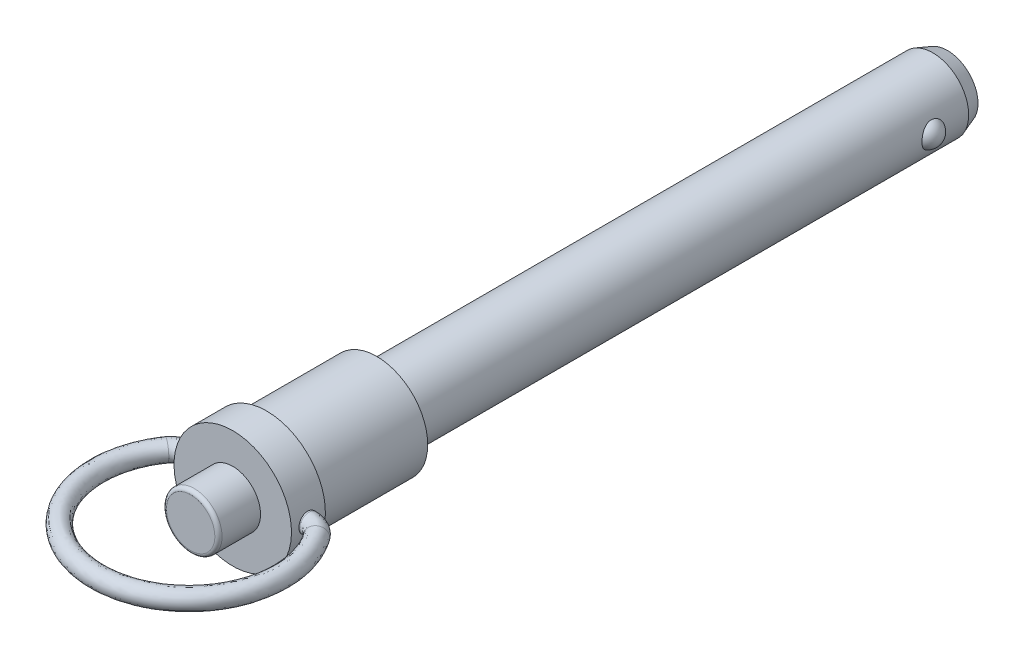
ISO-10303-21;
HEADER;
FILE_DESCRIPTION(('STEP AP214'),'2;1');
FILE_NAME('part.step','',(''),(''),'','','');
FILE_SCHEMA(('AUTOMOTIVE_DESIGN { 1 0 10303 214 1 1 1 1 }'));
ENDSEC;
DATA;
#1=APPLICATION_CONTEXT('core data for automotive mechanical design processes');
#2=APPLICATION_PROTOCOL_DEFINITION('international standard','automotive_design',2000,#1);
#3=PRODUCT_CONTEXT('',#1,'mechanical');
#4=PRODUCT('Part','Part','',(#3));
#5=PRODUCT_RELATED_PRODUCT_CATEGORY('part','',(#4));
#6=PRODUCT_DEFINITION_FORMATION('','',#4);
#7=PRODUCT_DEFINITION_CONTEXT('part definition',#1,'design');
#8=PRODUCT_DEFINITION('design','',#6,#7);
#9=PRODUCT_DEFINITION_SHAPE('','',#8);
#10=(LENGTH_UNIT() NAMED_UNIT(*) SI_UNIT(.MILLI.,.METRE.));
#11=(NAMED_UNIT(*) PLANE_ANGLE_UNIT() SI_UNIT($,.RADIAN.));
#12=(NAMED_UNIT(*) SI_UNIT($,.STERADIAN.) SOLID_ANGLE_UNIT());
#13=UNCERTAINTY_MEASURE_WITH_UNIT(LENGTH_MEASURE(1.E-05),#10,'distance_accuracy_value','');
#14=(GEOMETRIC_REPRESENTATION_CONTEXT(3) GLOBAL_UNCERTAINTY_ASSIGNED_CONTEXT((#13)) GLOBAL_UNIT_ASSIGNED_CONTEXT((#10,
#11,#12)) REPRESENTATION_CONTEXT('',''));
#15=CARTESIAN_POINT('',(0.,0.,0.));
#16=DIRECTION('',(0.,0.,1.));
#17=DIRECTION('',(1.,0.,0.));
#18=AXIS2_PLACEMENT_3D('',#15,#16,#17);
#19=CARTESIAN_POINT('',(0.,0.,25.765));
#20=DIRECTION('',(0.,0.,1.));
#21=DIRECTION('',(1.,0.,0.));
#22=AXIS2_PLACEMENT_3D('',#19,#20,#21);
#23=PLANE('',#22);
#24=CARTESIAN_POINT('',(0.,0.,25.765));
#25=DIRECTION('',(0.,0.,1.));
#26=DIRECTION('',(1.,0.,0.));
#27=AXIS2_PLACEMENT_3D('',#24,#25,#26);
#28=CIRCLE('',#27,3.3481);
#29=CARTESIAN_POINT('',(3.3481,0.,25.765));
#30=VERTEX_POINT('',#29);
#31=EDGE_CURVE('E141',#30,#30,#28,.T.);
#32=ORIENTED_EDGE('',*,*,#31,.T.);
#33=EDGE_LOOP('',(#32));
#34=FACE_BOUND('',#33,.T.);
#35=ADVANCED_FACE('F13',(#34),#23,.T.);
#36=CARTESIAN_POINT('',(0.,0.,25.265));
#37=DIRECTION('',(0.,0.,1.));
#38=DIRECTION('',(1.,0.,0.));
#39=AXIS2_PLACEMENT_3D('',#36,#37,#38);
#40=TOROIDAL_SURFACE('',#39,3.3481,0.5);
#41=CARTESIAN_POINT('',(0.,0.,25.265));
#42=DIRECTION('',(0.,0.,1.));
#43=DIRECTION('',(1.,0.,0.));
#44=AXIS2_PLACEMENT_3D('',#41,#42,#43);
#45=CIRCLE('',#44,3.8481);
#46=CARTESIAN_POINT('',(3.8481,0.,25.265));
#47=VERTEX_POINT('',#46);
#48=EDGE_CURVE('E138',#47,#47,#45,.T.);
#49=ORIENTED_EDGE('',*,*,#48,.T.);
#50=EDGE_LOOP('',(#49));
#51=FACE_BOUND('',#50,.T.);
#52=ORIENTED_EDGE('',*,*,#31,.F.);
#53=EDGE_LOOP('',(#52));
#54=FACE_BOUND('',#53,.T.);
#55=ADVANCED_FACE('F76',(#51,#54),#40,.T.);
#56=CARTESIAN_POINT('',(11.4497733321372,0.,17.9437724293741));
#57=CARTESIAN_POINT('',(11.8265676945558,0.,18.4801460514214));
#58=CARTESIAN_POINT('',(12.6551080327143,0.,19.8662433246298));
#59=CARTESIAN_POINT('',(13.4882796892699,0.,22.0133244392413));
#60=CARTESIAN_POINT('',(14.0014195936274,0.,24.4938075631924));
#61=CARTESIAN_POINT('',(14.0399868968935,0.,27.1482100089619));
#62=CARTESIAN_POINT('',(13.5501253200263,0.,29.8733661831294));
#63=CARTESIAN_POINT('',(12.5103672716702,0.,32.4943169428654));
#64=CARTESIAN_POINT('',(10.9649059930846,0.,34.8529407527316));
#65=CARTESIAN_POINT('',(9.01915526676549,0.,36.8217510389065));
#66=CARTESIAN_POINT('',(6.82219687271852,0.,38.3176313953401));
#67=CARTESIAN_POINT('',(4.51156788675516,0.,39.3254677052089));
#68=CARTESIAN_POINT('',(2.23137128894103,0.,39.879227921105));
#69=CARTESIAN_POINT('',(7.28333001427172E-13,0.,40.0580345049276));
#70=CARTESIAN_POINT('',(-2.23137128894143,0.,39.879227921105));
#71=CARTESIAN_POINT('',(-4.51156788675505,0.,39.3254677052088));
#72=CARTESIAN_POINT('',(-6.82219687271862,0.,38.31763139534));
#73=CARTESIAN_POINT('',(-9.01915526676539,0.,36.8217510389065));
#74=CARTESIAN_POINT('',(-10.9649059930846,0.,34.8529407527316));
#75=CARTESIAN_POINT('',(-12.5103672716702,0.,32.4943169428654));
#76=CARTESIAN_POINT('',(-13.5501253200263,0.,29.8733661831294));
#77=CARTESIAN_POINT('',(-14.0399868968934,0.,27.148210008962));
#78=CARTESIAN_POINT('',(-14.0014195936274,0.,24.4938075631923));
#79=CARTESIAN_POINT('',(-13.4882796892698,0.,22.0133244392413));
#80=CARTESIAN_POINT('',(-12.6551080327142,0.,19.8662433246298));
#81=CARTESIAN_POINT('',(-11.8265676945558,0.,18.4801460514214));
#82=CARTESIAN_POINT('',(-11.4497733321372,0.,17.9437724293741));
#83=CARTESIAN_POINT('',(11.4497733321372,-2.59999999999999,17.9437724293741));
#84=CARTESIAN_POINT('',(11.7096770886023,-2.59999999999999,18.3137501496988));
#85=CARTESIAN_POINT('',(12.7137877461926,-2.59999999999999,19.9497749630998));
#86=CARTESIAN_POINT('',(13.4708176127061,-2.59999999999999,21.9884668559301));
#87=CARTESIAN_POINT('',(14.0065482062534,-2.6,24.5011082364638));
#88=CARTESIAN_POINT('',(14.0385176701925,-2.59999999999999,27.1461185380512));
#89=CARTESIAN_POINT('',(13.5505344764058,-2.59999999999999,29.8739486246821));
#90=CARTESIAN_POINT('',(12.5102566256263,-2.59999999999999,32.4941594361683));
#91=CARTESIAN_POINT('',(10.9649350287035,-2.59999999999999,34.8529820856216));
#92=CARTESIAN_POINT('',(9.01914786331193,-2.6,36.8217404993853));
#93=CARTESIAN_POINT('',(6.82219870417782,-2.59999999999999,38.3176340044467));
#94=CARTESIAN_POINT('',(4.51156744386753,-2.59999999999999,39.3254670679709));
#95=CARTESIAN_POINT('',(2.23137138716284,-2.59999999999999,39.879228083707));
#96=CARTESIAN_POINT('',(7.28268272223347E-13,-2.59999999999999,40.0580344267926));
#97=CARTESIAN_POINT('',(-2.23137138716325,-2.6,39.879228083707));
#98=CARTESIAN_POINT('',(-4.51156744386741,-2.59999999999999,39.3254670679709));
#99=CARTESIAN_POINT('',(-6.82219870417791,-2.6,38.3176340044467));
#100=CARTESIAN_POINT('',(-9.01914786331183,-2.59999999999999,36.8217404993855));
#101=CARTESIAN_POINT('',(-10.9649350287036,-2.59999999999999,34.8529820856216));
#102=CARTESIAN_POINT('',(-12.5102566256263,-2.59999999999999,32.4941594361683));
#103=CARTESIAN_POINT('',(-13.5505344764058,-2.59999999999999,29.8739486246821));
#104=CARTESIAN_POINT('',(-14.0385176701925,-2.6,27.1461185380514));
#105=CARTESIAN_POINT('',(-14.0065482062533,-2.59999999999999,24.5011082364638));
#106=CARTESIAN_POINT('',(-13.4708176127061,-2.59999999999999,21.9884668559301));
#107=CARTESIAN_POINT('',(-12.7137877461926,-2.59999999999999,19.9497749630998));
#108=CARTESIAN_POINT('',(-11.7096770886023,-2.59999999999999,18.3137501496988));
#109=CARTESIAN_POINT('',(-11.4497733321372,-2.59999999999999,17.9437724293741));
#110=CARTESIAN_POINT('',(9.33442519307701,-2.59999999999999,19.4556422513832));
#111=CARTESIAN_POINT('',(9.59432894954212,-2.59999999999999,19.8256199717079));
#112=CARTESIAN_POINT('',(10.3328710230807,-2.59999999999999,21.0505437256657));
#113=CARTESIAN_POINT('',(10.9823054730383,-2.59999999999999,22.7644201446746));
#114=CARTESIAN_POINT('',(11.4042672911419,-2.6,24.7888114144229));
#115=CARTESIAN_POINT('',(11.4306312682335,-2.59999999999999,26.9493701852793));
#116=CARTESIAN_POINT('',(11.0308912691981,-2.59999999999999,29.1626260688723));
#117=CARTESIAN_POINT('',(10.1828123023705,-2.59999999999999,31.2968985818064));
#118=CARTESIAN_POINT('',(8.92160036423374,-2.59999999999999,33.2166725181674));
#119=CARTESIAN_POINT('',(7.34098330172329,-2.6,34.8144779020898));
#120=CARTESIAN_POINT('',(5.5491258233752,-2.59999999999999,36.0332448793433));
#121=CARTESIAN_POINT('',(3.67550207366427,-2.59999999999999,36.8497543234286));
#122=CARTESIAN_POINT('',(1.8109997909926,-2.59999999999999,37.3021941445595));
#123=CARTESIAN_POINT('',(-9.61358135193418E-13,-2.59999999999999,37.4469985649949));
#124=CARTESIAN_POINT('',(-1.81099979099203,-2.6,37.3021941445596));
#125=CARTESIAN_POINT('',(-3.6755020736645,-2.59999999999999,36.8497543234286));
#126=CARTESIAN_POINT('',(-5.54912582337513,-2.6,36.0332448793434));
#127=CARTESIAN_POINT('',(-7.34098330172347,-2.59999999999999,34.8144779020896));
#128=CARTESIAN_POINT('',(-8.92160036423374,-2.59999999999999,33.2166725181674));
#129=CARTESIAN_POINT('',(-10.1828123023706,-2.59999999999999,31.2968985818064));
#130=CARTESIAN_POINT('',(-11.0308912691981,-2.59999999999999,29.1626260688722));
#131=CARTESIAN_POINT('',(-11.4306312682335,-2.6,26.9493701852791));
#132=CARTESIAN_POINT('',(-11.4042672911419,-2.59999999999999,24.7888114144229));
#133=CARTESIAN_POINT('',(-10.9823054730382,-2.59999999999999,22.7644201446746));
#134=CARTESIAN_POINT('',(-10.3328710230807,-2.59999999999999,21.0505437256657));
#135=CARTESIAN_POINT('',(-9.59432894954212,-2.59999999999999,19.8256199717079));
#136=CARTESIAN_POINT('',(-9.33442519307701,-2.59999999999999,19.4556422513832));
#137=CARTESIAN_POINT('',(9.33442519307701,0.,19.4556422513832));
#138=CARTESIAN_POINT('',(9.65277425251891,0.,19.9088179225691));
#139=CARTESIAN_POINT('',(10.3035311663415,0.,21.0087779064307));
#140=CARTESIAN_POINT('',(10.9910365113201,0.,22.7768489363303));
#141=CARTESIAN_POINT('',(11.4017029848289,0.,24.7851610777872));
#142=CARTESIAN_POINT('',(11.431365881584,0.,26.9504159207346));
#143=CARTESIAN_POINT('',(11.0306866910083,0.,29.1623348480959));
#144=CARTESIAN_POINT('',(10.1828676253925,0.,31.2969773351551));
#145=CARTESIAN_POINT('',(8.92158584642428,0.,33.2166518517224));
#146=CARTESIAN_POINT('',(7.34098700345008,0.,34.8144831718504));
#147=CARTESIAN_POINT('',(5.54912490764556,0.,36.03324357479));
#148=CARTESIAN_POINT('',(3.67550229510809,0.,36.8497546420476));
#149=CARTESIAN_POINT('',(1.8109997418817,0.,37.3021940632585));
#150=CARTESIAN_POINT('',(-9.6127182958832E-13,0.,37.4469986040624));
#151=CARTESIAN_POINT('',(-1.81099974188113,0.,37.3021940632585));
#152=CARTESIAN_POINT('',(-3.67550229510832,0.,36.8497546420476));
#153=CARTESIAN_POINT('',(-5.54912490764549,0.,36.03324357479));
#154=CARTESIAN_POINT('',(-7.34098700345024,0.,34.8144831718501));
#155=CARTESIAN_POINT('',(-8.92158584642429,0.,33.2166518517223));
#156=CARTESIAN_POINT('',(-10.1828676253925,0.,31.296977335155));
#157=CARTESIAN_POINT('',(-11.0306866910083,0.,29.1623348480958));
#158=CARTESIAN_POINT('',(-11.431365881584,0.,26.9504159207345));
#159=CARTESIAN_POINT('',(-11.4017029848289,0.,24.7851610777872));
#160=CARTESIAN_POINT('',(-10.9910365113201,0.,22.7768489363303));
#161=CARTESIAN_POINT('',(-10.3035311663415,0.,21.0087779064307));
#162=CARTESIAN_POINT('',(-9.6527742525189,0.,19.9088179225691));
#163=CARTESIAN_POINT('',(-9.33442519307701,0.,19.4556422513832));
#164=CARTESIAN_POINT('',(9.33442519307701,2.59999999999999,19.4556422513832));
#165=CARTESIAN_POINT('',(9.7112195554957,2.59999999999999,19.9920158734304));
#166=CARTESIAN_POINT('',(10.2741913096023,2.59999999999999,20.9670120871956));
#167=CARTESIAN_POINT('',(10.999767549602,2.59999999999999,22.7892777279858));
#168=CARTESIAN_POINT('',(11.3991386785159,2.6,24.7815107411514));
#169=CARTESIAN_POINT('',(11.4321004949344,2.59999999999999,26.9514616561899));
#170=CARTESIAN_POINT('',(11.0304821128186,2.59999999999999,29.1620436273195));
#171=CARTESIAN_POINT('',(10.1829229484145,2.59999999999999,31.2970560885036));
#172=CARTESIAN_POINT('',(8.92157132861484,2.59999999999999,33.2166311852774));
#173=CARTESIAN_POINT('',(7.34099070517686,2.6,34.8144884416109));
#174=CARTESIAN_POINT('',(5.54912399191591,2.59999999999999,36.0332422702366));
#175=CARTESIAN_POINT('',(3.67550251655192,2.59999999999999,36.8497549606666));
#176=CARTESIAN_POINT('',(1.81099969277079,2.59999999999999,37.3021939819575));
#177=CARTESIAN_POINT('',(-9.61422864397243E-13,2.59999999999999,37.4469986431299));
#178=CARTESIAN_POINT('',(-1.81099969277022,2.6,37.3021939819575));
#179=CARTESIAN_POINT('',(-3.67550251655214,2.59999999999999,36.8497549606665));
#180=CARTESIAN_POINT('',(-5.54912399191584,2.6,36.0332422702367));
#181=CARTESIAN_POINT('',(-7.34099070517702,2.59999999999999,34.8144884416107));
#182=CARTESIAN_POINT('',(-8.92157132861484,2.59999999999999,33.2166311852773));
#183=CARTESIAN_POINT('',(-10.1829229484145,2.59999999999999,31.2970560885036));
#184=CARTESIAN_POINT('',(-11.0304821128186,2.59999999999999,29.1620436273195));
#185=CARTESIAN_POINT('',(-11.4321004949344,2.6,26.9514616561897));
#186=CARTESIAN_POINT('',(-11.3991386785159,2.59999999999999,24.7815107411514));
#187=CARTESIAN_POINT('',(-10.999767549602,2.59999999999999,22.7892777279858));
#188=CARTESIAN_POINT('',(-10.2741913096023,2.59999999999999,20.9670120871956));
#189=CARTESIAN_POINT('',(-9.71121955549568,2.59999999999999,19.9920158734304));
#190=CARTESIAN_POINT('',(-9.33442519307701,2.59999999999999,19.4556422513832));
#191=CARTESIAN_POINT('',(11.4497733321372,2.59999999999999,17.9437724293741));
#192=CARTESIAN_POINT('',(11.9434583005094,2.59999999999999,18.6465419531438));
#193=CARTESIAN_POINT('',(12.5964283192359,2.59999999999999,19.7827116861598));
#194=CARTESIAN_POINT('',(13.5057417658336,2.59999999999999,22.0381820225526));
#195=CARTESIAN_POINT('',(13.9962909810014,2.6,24.4865068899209));
#196=CARTESIAN_POINT('',(14.0414561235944,2.59999999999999,27.1503014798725));
#197=CARTESIAN_POINT('',(13.5497161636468,2.59999999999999,29.8727837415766));
#198=CARTESIAN_POINT('',(12.5104779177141,2.59999999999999,32.4944744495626));
#199=CARTESIAN_POINT('',(10.9648769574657,2.59999999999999,34.8528994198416));
#200=CARTESIAN_POINT('',(9.01916267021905,2.6,36.8217615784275));
#201=CARTESIAN_POINT('',(6.82219504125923,2.59999999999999,38.3176287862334));
#202=CARTESIAN_POINT('',(4.5115683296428,2.59999999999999,39.3254683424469));
#203=CARTESIAN_POINT('',(2.23137119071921,2.59999999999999,39.8792277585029));
#204=CARTESIAN_POINT('',(7.28203543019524E-13,2.59999999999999,40.0580345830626));
#205=CARTESIAN_POINT('',(-2.23137119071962,2.6,39.879227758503));
#206=CARTESIAN_POINT('',(-4.51156832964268,2.59999999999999,39.3254683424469));
#207=CARTESIAN_POINT('',(-6.82219504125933,2.6,38.3176287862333));
#208=CARTESIAN_POINT('',(-9.01916267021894,2.59999999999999,36.8217615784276));
#209=CARTESIAN_POINT('',(-10.9648769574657,2.59999999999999,34.8528994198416));
#210=CARTESIAN_POINT('',(-12.5104779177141,2.59999999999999,32.4944744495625));
#211=CARTESIAN_POINT('',(-13.5497161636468,2.59999999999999,29.8727837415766));
#212=CARTESIAN_POINT('',(-14.0414561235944,2.6,27.1503014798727));
#213=CARTESIAN_POINT('',(-13.9962909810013,2.59999999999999,24.4865068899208));
#214=CARTESIAN_POINT('',(-13.5057417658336,2.59999999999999,22.0381820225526));
#215=CARTESIAN_POINT('',(-12.5964283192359,2.59999999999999,19.7827116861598));
#216=CARTESIAN_POINT('',(-11.9434583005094,2.59999999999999,18.6465419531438));
#217=CARTESIAN_POINT('',(-11.4497733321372,2.59999999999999,17.9437724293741));
#218=CARTESIAN_POINT('',(11.4497733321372,0.,17.9437724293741));
#219=CARTESIAN_POINT('',(11.8265676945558,0.,18.4801460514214));
#220=CARTESIAN_POINT('',(12.6551080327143,0.,19.8662433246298));
#221=CARTESIAN_POINT('',(13.4882796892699,0.,22.0133244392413));
#222=CARTESIAN_POINT('',(14.0014195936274,0.,24.4938075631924));
#223=CARTESIAN_POINT('',(14.0399868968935,0.,27.1482100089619));
#224=CARTESIAN_POINT('',(13.5501253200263,0.,29.8733661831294));
#225=CARTESIAN_POINT('',(12.5103672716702,0.,32.4943169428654));
#226=CARTESIAN_POINT('',(10.9649059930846,0.,34.8529407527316));
#227=CARTESIAN_POINT('',(9.01915526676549,0.,36.8217510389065));
#228=CARTESIAN_POINT('',(6.82219687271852,0.,38.3176313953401));
#229=CARTESIAN_POINT('',(4.51156788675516,0.,39.3254677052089));
#230=CARTESIAN_POINT('',(2.23137128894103,0.,39.879227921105));
#231=CARTESIAN_POINT('',(7.28333001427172E-13,0.,40.0580345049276));
#232=CARTESIAN_POINT('',(-2.23137128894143,0.,39.879227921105));
#233=CARTESIAN_POINT('',(-4.51156788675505,0.,39.3254677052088));
#234=CARTESIAN_POINT('',(-6.82219687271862,0.,38.31763139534));
#235=CARTESIAN_POINT('',(-9.01915526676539,0.,36.8217510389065));
#236=CARTESIAN_POINT('',(-10.9649059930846,0.,34.8529407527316));
#237=CARTESIAN_POINT('',(-12.5103672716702,0.,32.4943169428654));
#238=CARTESIAN_POINT('',(-13.5501253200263,0.,29.8733661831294));
#239=CARTESIAN_POINT('',(-14.0399868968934,0.,27.148210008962));
#240=CARTESIAN_POINT('',(-14.0014195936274,0.,24.4938075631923));
#241=CARTESIAN_POINT('',(-13.4882796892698,0.,22.0133244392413));
#242=CARTESIAN_POINT('',(-12.6551080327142,0.,19.8662433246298));
#243=CARTESIAN_POINT('',(-11.8265676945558,0.,18.4801460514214));
#244=CARTESIAN_POINT('',(-11.4497733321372,0.,17.9437724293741));
#245=(BOUNDED_SURFACE() B_SPLINE_SURFACE(3,3,((#56,#57,#58,#59,#60,#61,#62,#63,#64,#65,#66,#67,
#68,#69,#70,#71,#72,#73,#74,#75,#76,#77,#78,#79,#80,#81,#82),(#83,#84,#85,#86,#87,#88,#89,#90,
#91,#92,#93,#94,#95,#96,#97,#98,#99,#100,#101,#102,#103,#104,#105,#106,#107,#108,#109),(#110,
#111,#112,#113,#114,#115,#116,#117,#118,#119,#120,#121,#122,#123,#124,#125,#126,#127,#128,#129,
#130,#131,#132,#133,#134,#135,#136),(#137,#138,#139,#140,#141,#142,#143,#144,#145,#146,#147,
#148,#149,#150,#151,#152,#153,#154,#155,#156,#157,#158,#159,#160,#161,#162,#163),(#164,#165,
#166,#167,#168,#169,#170,#171,#172,#173,#174,#175,#176,#177,#178,#179,#180,#181,#182,#183,#184,
#185,#186,#187,#188,#189,#190),(#191,#192,#193,#194,#195,#196,#197,#198,#199,#200,#201,#202,
#203,#204,#205,#206,#207,#208,#209,#210,#211,#212,#213,#214,#215,#216,#217),(#218,#219,#220,
#221,#222,#223,#224,#225,#226,#227,#228,#229,#230,#231,#232,#233,#234,#235,#236,#237,#238,#239,
#240,#241,#242,#243,#244)),.UNSPECIFIED.,.T.,.F.,.F.) B_SPLINE_SURFACE_WITH_KNOTS((4,3,4),(4,1,
1,1,1,1,1,1,1,1,1,1,1,1,1,1,1,1,1,1,1,1,1,1,4),(0.,0.5,1.),(0.,0.0355177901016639,
0.0739139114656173,0.114982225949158,0.158533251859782,0.203808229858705,0.250000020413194,
0.296191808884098,0.34146678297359,0.385017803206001,0.426086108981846,0.464482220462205,0.5,
0.535517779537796,0.573913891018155,0.614982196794,0.658533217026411,0.703808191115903,
0.749999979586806,0.796191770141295,0.841466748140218,0.885017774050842,0.926086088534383,
0.964482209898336,1.),
.UNSPECIFIED.) GEOMETRIC_REPRESENTATION_ITEM() RATIONAL_B_SPLINE_SURFACE(((1.,1.,1.,1.,1.,1.,1.,
1.,1.,1.,1.,1.,1.,1.,1.,1.,1.,1.,1.,1.,1.,1.,1.,1.,1.,1.,1.),(0.333333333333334,
0.333333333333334,0.333333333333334,0.333333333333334,0.333333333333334,0.333333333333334,
0.333333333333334,0.333333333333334,0.333333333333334,0.333333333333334,0.333333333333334,
0.333333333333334,0.333333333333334,0.333333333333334,0.333333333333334,0.333333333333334,
0.333333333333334,0.333333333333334,0.333333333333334,0.333333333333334,0.333333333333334,
0.333333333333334,0.333333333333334,0.333333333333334,0.333333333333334,0.333333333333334,
0.333333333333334),(0.333333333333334,0.333333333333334,0.333333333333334,0.333333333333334,
0.333333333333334,0.333333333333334,0.333333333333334,0.333333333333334,0.333333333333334,
0.333333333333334,0.333333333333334,0.333333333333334,0.333333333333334,0.333333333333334,
0.333333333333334,0.333333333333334,0.333333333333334,0.333333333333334,0.333333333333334,
0.333333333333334,0.333333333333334,0.333333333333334,0.333333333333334,0.333333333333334,
0.333333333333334,0.333333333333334,0.333333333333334),(1.,1.,1.,1.,1.,1.,1.,1.,1.,1.,1.,1.,1.,
1.,1.,1.,1.,1.,1.,1.,1.,1.,1.,1.,1.,1.,1.),(0.333333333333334,0.333333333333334,
0.333333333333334,0.333333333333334,0.333333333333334,0.333333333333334,0.333333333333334,
0.333333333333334,0.333333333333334,0.333333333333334,0.333333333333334,0.333333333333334,
0.333333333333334,0.333333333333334,0.333333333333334,0.333333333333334,0.333333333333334,
0.333333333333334,0.333333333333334,0.333333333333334,0.333333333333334,0.333333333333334,
0.333333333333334,0.333333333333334,0.333333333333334,0.333333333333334,0.333333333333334),
(0.333333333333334,0.333333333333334,0.333333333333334,0.333333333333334,0.333333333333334,
0.333333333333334,0.333333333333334,0.333333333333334,0.333333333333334,0.333333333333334,
0.333333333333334,0.333333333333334,0.333333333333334,0.333333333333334,0.333333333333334,
0.333333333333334,0.333333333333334,0.333333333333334,0.333333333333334,0.333333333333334,
0.333333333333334,0.333333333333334,0.333333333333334,0.333333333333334,0.333333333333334,
0.333333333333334,0.333333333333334),(1.,1.,1.,1.,1.,1.,1.,1.,1.,1.,1.,1.,1.,1.,1.,1.,1.,1.,1.,
1.,1.,1.,1.,1.,1.,1.,1.))) REPRESENTATION_ITEM('') SURFACE());
#246=CARTESIAN_POINT('',(11.4497733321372,0.,17.9437724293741));
#247=CARTESIAN_POINT('',(11.4497733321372,-2.59999999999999,17.9437724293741));
#248=CARTESIAN_POINT('',(9.33442519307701,-2.59999999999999,19.4556422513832));
#249=CARTESIAN_POINT('',(9.33442519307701,0.,19.4556422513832));
#250=CARTESIAN_POINT('',(9.33442519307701,2.59999999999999,19.4556422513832));
#251=CARTESIAN_POINT('',(11.4497733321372,2.59999999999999,17.9437724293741));
#252=CARTESIAN_POINT('',(11.4497733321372,0.,17.9437724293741));
#253=(BOUNDED_CURVE() B_SPLINE_CURVE(3,(#246,#247,#248,#249,#250,#251,#252),.UNSPECIFIED.,.T.,
.F.) B_SPLINE_CURVE_WITH_KNOTS((4,3,4),(0.,0.5,1.),
.UNSPECIFIED.) CURVE() GEOMETRIC_REPRESENTATION_ITEM() RATIONAL_B_SPLINE_CURVE((1.,
0.333333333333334,0.333333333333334,1.,0.333333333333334,0.333333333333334,1.)) REPRESENTATION_ITEM(''));
#254=CARTESIAN_POINT('',(11.4497733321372,0.,17.9437724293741));
#255=VERTEX_POINT('',#254);
#256=EDGE_CURVE('E176',#255,#255,#253,.T.);
#257=CARTESIAN_POINT('',(-11.4497733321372,0.,17.9437724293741));
#258=CARTESIAN_POINT('',(-11.4497733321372,-2.59999999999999,17.9437724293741));
#259=CARTESIAN_POINT('',(-9.33442519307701,-2.59999999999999,19.4556422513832));
#260=CARTESIAN_POINT('',(-9.33442519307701,0.,19.4556422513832));
#261=CARTESIAN_POINT('',(-9.33442519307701,2.59999999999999,19.4556422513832));
#262=CARTESIAN_POINT('',(-11.4497733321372,2.59999999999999,17.9437724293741));
#263=CARTESIAN_POINT('',(-11.4497733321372,0.,17.9437724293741));
#264=(BOUNDED_CURVE() B_SPLINE_CURVE(3,(#257,#258,#259,#260,#261,#262,#263),.UNSPECIFIED.,.T.,
.F.) B_SPLINE_CURVE_WITH_KNOTS((4,3,4),(0.,0.5,1.),
.UNSPECIFIED.) CURVE() GEOMETRIC_REPRESENTATION_ITEM() RATIONAL_B_SPLINE_CURVE((1.,
0.333333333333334,0.333333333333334,1.,0.333333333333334,0.333333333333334,1.)) REPRESENTATION_ITEM(''));
#265=CARTESIAN_POINT('',(-11.4497733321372,0.,17.9437724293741));
#266=VERTEX_POINT('',#265);
#267=EDGE_CURVE('E174',#266,#266,#264,.F.);
#268=ORIENTED_EDGE('',*,*,#256,.F.);
#269=EDGE_LOOP('',(#268));
#270=FACE_BOUND('',#269,.T.);
#271=ORIENTED_EDGE('',*,*,#267,.F.);
#272=EDGE_LOOP('',(#271));
#273=FACE_BOUND('',#272,.T.);
#274=ADVANCED_FACE('F82',(#270,#273),#245,.F.);
#275=CARTESIAN_POINT('',(8.23717073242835,0.,16.3022));
#276=CARTESIAN_POINT('',(8.39026579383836,0.,16.3022));
#277=CARTESIAN_POINT('',(8.96971374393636,0.,16.3453113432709));
#278=CARTESIAN_POINT('',(9.59211406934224,0.,16.5211040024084));
#279=CARTESIAN_POINT('',(10.3031381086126,0.,16.8555507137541));
#280=CARTESIAN_POINT('',(10.8955792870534,0.,17.2786190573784));
#281=CARTESIAN_POINT('',(11.3434296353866,0.,17.7975125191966));
#282=CARTESIAN_POINT('',(11.4497733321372,0.,17.9437724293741));
#283=CARTESIAN_POINT('',(8.23717073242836,2.59999999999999,16.3022));
#284=CARTESIAN_POINT('',(8.16213736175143,2.59999999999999,16.3022));
#285=CARTESIAN_POINT('',(9.0792865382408,2.59999999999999,16.3469383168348));
#286=CARTESIAN_POINT('',(9.55822083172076,2.6,16.5152316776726));
#287=CARTESIAN_POINT('',(10.3298909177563,2.59999999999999,16.879237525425));
#288=CARTESIAN_POINT('',(10.8172738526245,2.59999999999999,17.1748054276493));
#289=CARTESIAN_POINT('',(11.5008843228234,2.59999999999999,18.0140679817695));
#290=CARTESIAN_POINT('',(11.4497733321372,2.59999999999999,17.9437724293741));
#291=CARTESIAN_POINT('',(8.23717073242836,2.59999999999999,18.9022));
#292=CARTESIAN_POINT('',(8.16213736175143,2.59999999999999,18.9022));
#293=CARTESIAN_POINT('',(8.54034086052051,2.59999999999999,18.9167455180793));
#294=CARTESIAN_POINT('',(8.68812752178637,2.6,18.9762506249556));
#295=CARTESIAN_POINT('',(8.94759350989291,2.59999999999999,19.0969960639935));
#296=CARTESIAN_POINT('',(9.10292826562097,2.59999999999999,19.1770581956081));
#297=CARTESIAN_POINT('',(9.38553618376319,2.59999999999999,19.5259378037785));
#298=CARTESIAN_POINT('',(9.33442519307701,2.59999999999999,19.4556422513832));
#299=CARTESIAN_POINT('',(8.23717073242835,0.,18.9022));
#300=CARTESIAN_POINT('',(8.2762015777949,0.,18.9022));
#301=CARTESIAN_POINT('',(8.48555446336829,0.,18.9159320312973));
#302=CARTESIAN_POINT('',(8.70507414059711,0.,18.9791867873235));
#303=CARTESIAN_POINT('',(8.93421710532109,0.,19.0851526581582));
#304=CARTESIAN_POINT('',(9.14208098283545,0.,19.2289650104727));
#305=CARTESIAN_POINT('',(9.30680884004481,0.,19.4176600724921));
#306=CARTESIAN_POINT('',(9.33442519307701,0.,19.4556422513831));
#307=CARTESIAN_POINT('',(8.23717073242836,-2.59999999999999,18.9022));
#308=CARTESIAN_POINT('',(8.39026579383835,-2.59999999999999,18.9022));
#309=CARTESIAN_POINT('',(8.43076806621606,-2.59999999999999,18.9151185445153));
#310=CARTESIAN_POINT('',(8.72202075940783,-2.6,18.9821229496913));
#311=CARTESIAN_POINT('',(8.92084070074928,-2.59999999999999,19.0733092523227));
#312=CARTESIAN_POINT('',(9.1812337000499,-2.59999999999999,19.2808718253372));
#313=CARTESIAN_POINT('',(9.22808149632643,-2.59999999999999,19.3093823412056));
#314=CARTESIAN_POINT('',(9.33442519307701,-2.59999999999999,19.4556422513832));
#315=CARTESIAN_POINT('',(8.23717073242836,-2.59999999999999,16.3022));
#316=CARTESIAN_POINT('',(8.61839422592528,-2.59999999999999,16.3022));
#317=CARTESIAN_POINT('',(8.8601409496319,-2.59999999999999,16.3436843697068));
#318=CARTESIAN_POINT('',(9.6260073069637,-2.6,16.5269763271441));
#319=CARTESIAN_POINT('',(10.276385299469,-2.59999999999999,16.8318639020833));
#320=CARTESIAN_POINT('',(10.9738847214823,-2.59999999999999,17.3824326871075));
#321=CARTESIAN_POINT('',(11.1859749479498,-2.59999999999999,17.5809570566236));
#322=CARTESIAN_POINT('',(11.4497733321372,-2.59999999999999,17.9437724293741));
#323=CARTESIAN_POINT('',(8.23717073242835,0.,16.3022));
#324=CARTESIAN_POINT('',(8.39026579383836,0.,16.3022));
#325=CARTESIAN_POINT('',(8.96971374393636,0.,16.3453113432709));
#326=CARTESIAN_POINT('',(9.59211406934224,0.,16.5211040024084));
#327=CARTESIAN_POINT('',(10.3031381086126,0.,16.8555507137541));
#328=CARTESIAN_POINT('',(10.8955792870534,0.,17.2786190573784));
#329=CARTESIAN_POINT('',(11.3434296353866,0.,17.7975125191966));
#330=CARTESIAN_POINT('',(11.4497733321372,0.,17.9437724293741));
#331=(BOUNDED_SURFACE() B_SPLINE_SURFACE(3,3,((#275,#276,#277,#278,#279,#280,#281,#282),(#283,
#284,#285,#286,#287,#288,#289,#290),(#291,#292,#293,#294,#295,#296,#297,#298),(#299,#300,#301,
#302,#303,#304,#305,#306),(#307,#308,#309,#310,#311,#312,#313,#314),(#315,#316,#317,#318,#319,
#320,#321,#322),(#323,#324,#325,#326,#327,#328,#329,#330)),.UNSPECIFIED.,.T.,.F.,
.F.) B_SPLINE_SURFACE_WITH_KNOTS((4,3,4),(4,1,1,1,1,4),(0.,0.5,1.),(0.,0.183393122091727,
0.371127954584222,0.561360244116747,0.78346967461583,1.),
.UNSPECIFIED.) GEOMETRIC_REPRESENTATION_ITEM() RATIONAL_B_SPLINE_SURFACE(((1.,1.,1.,1.,1.,1.,1.,
1.),(0.333333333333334,0.333333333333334,0.333333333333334,0.333333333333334,0.333333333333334,
0.333333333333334,0.333333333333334,0.333333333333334),(0.333333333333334,0.333333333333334,
0.333333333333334,0.333333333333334,0.333333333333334,0.333333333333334,0.333333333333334,
0.333333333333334),(1.,1.,1.,1.,1.,1.,1.,1.),(0.333333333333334,0.333333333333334,
0.333333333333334,0.333333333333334,0.333333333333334,0.333333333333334,0.333333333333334,
0.333333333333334),(0.333333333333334,0.333333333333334,0.333333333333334,0.333333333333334,
0.333333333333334,0.333333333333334,0.333333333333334,0.333333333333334),(1.,1.,1.,1.,1.,1.,1.,1.))) REPRESENTATION_ITEM('') SURFACE());
#332=CARTESIAN_POINT('',(8.23717073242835,0.,17.6022));
#333=DIRECTION('',(1.,0.,0.));
#334=DIRECTION('',(0.,0.,-1.));
#335=AXIS2_PLACEMENT_3D('',#332,#333,#334);
#336=CIRCLE('',#335,1.3);
#337=CARTESIAN_POINT('',(8.23717073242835,0.,16.3022));
#338=VERTEX_POINT('',#337);
#339=EDGE_CURVE('E112',#338,#338,#336,.T.);
#340=ORIENTED_EDGE('',*,*,#339,.T.);
#341=EDGE_LOOP('',(#340));
#342=FACE_BOUND('',#341,.T.);
#343=ORIENTED_EDGE('',*,*,#256,.T.);
#344=EDGE_LOOP('',(#343));
#345=FACE_BOUND('',#344,.T.);
#346=ADVANCED_FACE('F92',(#342,#345),#331,.T.);
#347=CARTESIAN_POINT('',(0.,0.,24.765));
#348=DIRECTION('',(0.,0.,-1.));
#349=DIRECTION('',(0.,1.,0.));
#350=AXIS2_PLACEMENT_3D('',#347,#348,#349);
#351=CYLINDRICAL_SURFACE('',#350,3.8481);
#352=CARTESIAN_POINT('',(0.,0.,19.939));
#353=DIRECTION('',(0.,0.,-1.));
#354=DIRECTION('',(0.,1.,0.));
#355=AXIS2_PLACEMENT_3D('',#352,#353,#354);
#356=CIRCLE('',#355,3.8481);
#357=CARTESIAN_POINT('',(0.,3.8481,19.939));
#358=VERTEX_POINT('',#357);
#359=EDGE_CURVE('E148',#358,#358,#356,.T.);
#360=ORIENTED_EDGE('',*,*,#359,.F.);
#361=EDGE_LOOP('',(#360));
#362=FACE_BOUND('',#361,.T.);
#363=ORIENTED_EDGE('',*,*,#48,.F.);
#364=EDGE_LOOP('',(#363));
#365=FACE_BOUND('',#364,.T.);
#366=ADVANCED_FACE('F88',(#362,#365),#351,.T.);
#367=CARTESIAN_POINT('',(-11.4497733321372,0.,17.9437724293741));
#368=CARTESIAN_POINT('',(-11.3597411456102,0.,17.8199465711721));
#369=CARTESIAN_POINT('',(-10.985804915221,0.,17.3752654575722));
#370=CARTESIAN_POINT('',(-10.4784291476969,0.,16.9741029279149));
#371=CARTESIAN_POINT('',(-9.7908926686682,0.,16.5936956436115));
#372=CARTESIAN_POINT('',(-9.10089921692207,0.,16.3618307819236));
#373=CARTESIAN_POINT('',(-8.41800257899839,0.,16.3022));
#374=CARTESIAN_POINT('',(-8.23717073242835,0.,16.3022));
#375=CARTESIAN_POINT('',(-11.4497733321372,2.59999999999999,17.9437724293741));
#376=CARTESIAN_POINT('',(-11.4938947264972,2.59999999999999,18.0044548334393));
#377=CARTESIAN_POINT('',(-10.9200537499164,2.59999999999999,17.2876012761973));
#378=CARTESIAN_POINT('',(-10.503110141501,2.6,16.9980618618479));
#379=CARTESIAN_POINT('',(-9.75600116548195,2.59999999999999,16.585987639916));
#380=CARTESIAN_POINT('',(-9.23091765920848,2.59999999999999,16.3641146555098));
#381=CARTESIAN_POINT('',(-8.15024985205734,2.59999999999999,16.3022));
#382=CARTESIAN_POINT('',(-8.23717073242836,2.59999999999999,16.3022));
#383=CARTESIAN_POINT('',(-9.33442519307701,2.59999999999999,19.4556422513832));
#384=CARTESIAN_POINT('',(-9.37854658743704,2.59999999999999,19.5163246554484));
#385=CARTESIAN_POINT('',(-9.14268985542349,2.59999999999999,19.2203693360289));
#386=CARTESIAN_POINT('',(-9.00682479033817,2.6,19.1369648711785));
#387=CARTESIAN_POINT('',(-8.7554763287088,2.59999999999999,19.0001197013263));
#388=CARTESIAN_POINT('',(-8.59879927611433,2.59999999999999,18.9230559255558));
#389=CARTESIAN_POINT('',(-8.15024985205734,2.59999999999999,18.9022));
#390=CARTESIAN_POINT('',(-8.23717073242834,2.59999999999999,18.9022));
#391=CARTESIAN_POINT('',(-9.334425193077,0.,19.4556422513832));
#392=CARTESIAN_POINT('',(-9.31146979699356,0.,19.4240705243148));
#393=CARTESIAN_POINT('',(-9.17556543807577,0.,19.2642014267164));
#394=CARTESIAN_POINT('',(-8.99448429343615,0.,19.124985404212));
#395=CARTESIAN_POINT('',(-8.77292208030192,0.,19.0039737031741));
#396=CARTESIAN_POINT('',(-8.53379005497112,0.,18.9219139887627));
#397=CARTESIAN_POINT('',(-8.28412621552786,0.,18.9022));
#398=CARTESIAN_POINT('',(-8.23717073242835,0.,18.9022));
#399=CARTESIAN_POINT('',(-9.33442519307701,-2.59999999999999,19.4556422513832));
#400=CARTESIAN_POINT('',(-9.24439300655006,-2.59999999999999,19.3318163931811));
#401=CARTESIAN_POINT('',(-9.20844102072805,-2.59999999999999,19.3080335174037));
#402=CARTESIAN_POINT('',(-8.98214379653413,-2.6,19.1130059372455));
#403=CARTESIAN_POINT('',(-8.79036783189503,-2.59999999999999,19.0078277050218));
#404=CARTESIAN_POINT('',(-8.46878083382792,-2.59999999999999,18.9207720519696));
#405=CARTESIAN_POINT('',(-8.41800257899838,-2.59999999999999,18.9022));
#406=CARTESIAN_POINT('',(-8.23717073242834,-2.59999999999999,18.9022));
#407=CARTESIAN_POINT('',(-11.4497733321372,-2.59999999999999,17.9437724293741));
#408=CARTESIAN_POINT('',(-11.2255875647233,-2.59999999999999,17.6354383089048));
#409=CARTESIAN_POINT('',(-11.0515560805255,-2.59999999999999,17.4629296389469));
#410=CARTESIAN_POINT('',(-10.4537481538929,-2.6,16.9501439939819));
#411=CARTESIAN_POINT('',(-9.82578417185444,-2.59999999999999,16.6014036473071));
#412=CARTESIAN_POINT('',(-8.97088077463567,-2.59999999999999,16.3595469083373));
#413=CARTESIAN_POINT('',(-8.68575530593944,-2.59999999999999,16.3022));
#414=CARTESIAN_POINT('',(-8.23717073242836,-2.59999999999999,16.3022));
#415=CARTESIAN_POINT('',(-11.4497733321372,0.,17.9437724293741));
#416=CARTESIAN_POINT('',(-11.3597411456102,0.,17.8199465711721));
#417=CARTESIAN_POINT('',(-10.985804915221,0.,17.3752654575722));
#418=CARTESIAN_POINT('',(-10.4784291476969,0.,16.9741029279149));
#419=CARTESIAN_POINT('',(-9.7908926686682,0.,16.5936956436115));
#420=CARTESIAN_POINT('',(-9.10089921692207,0.,16.3618307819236));
#421=CARTESIAN_POINT('',(-8.41800257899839,0.,16.3022));
#422=CARTESIAN_POINT('',(-8.23717073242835,0.,16.3022));
#423=(BOUNDED_SURFACE() B_SPLINE_SURFACE(3,3,((#367,#368,#369,#370,#371,#372,#373,#374),(#375,
#376,#377,#378,#379,#380,#381,#382),(#383,#384,#385,#386,#387,#388,#389,#390),(#391,#392,#393,
#394,#395,#396,#397,#398),(#399,#400,#401,#402,#403,#404,#405,#406),(#407,#408,#409,#410,#411,
#412,#413,#414),(#415,#416,#417,#418,#419,#420,#421,#422)),.UNSPECIFIED.,.T.,.F.,
.F.) B_SPLINE_SURFACE_WITH_KNOTS((4,3,4),(4,1,1,1,1,4),(0.,0.5,1.),(0.,0.183394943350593,
0.371130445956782,0.561362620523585,0.783471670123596,1.),
.UNSPECIFIED.) GEOMETRIC_REPRESENTATION_ITEM() RATIONAL_B_SPLINE_SURFACE(((1.,1.,1.,1.,1.,1.,1.,
1.),(0.333333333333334,0.333333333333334,0.333333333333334,0.333333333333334,0.333333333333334,
0.333333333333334,0.333333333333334,0.333333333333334),(0.333333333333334,0.333333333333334,
0.333333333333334,0.333333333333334,0.333333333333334,0.333333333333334,0.333333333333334,
0.333333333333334),(1.,1.,1.,1.,1.,1.,1.,1.),(0.333333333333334,0.333333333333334,
0.333333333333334,0.333333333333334,0.333333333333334,0.333333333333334,0.333333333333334,
0.333333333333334),(0.333333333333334,0.333333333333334,0.333333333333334,0.333333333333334,
0.333333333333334,0.333333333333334,0.333333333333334,0.333333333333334),(1.,1.,1.,1.,1.,1.,1.,1.))) REPRESENTATION_ITEM('') SURFACE());
#424=CARTESIAN_POINT('',(-8.23717073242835,0.,17.6022));
#425=DIRECTION('',(-1.,0.,0.));
#426=DIRECTION('',(0.,0.,1.));
#427=AXIS2_PLACEMENT_3D('',#424,#425,#426);
#428=CIRCLE('',#427,1.3);
#429=CARTESIAN_POINT('',(-8.23717073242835,0.,18.9022));
#430=VERTEX_POINT('',#429);
#431=EDGE_CURVE('E180',#430,#430,#428,.T.);
#432=ORIENTED_EDGE('',*,*,#267,.T.);
#433=EDGE_LOOP('',(#432));
#434=FACE_BOUND('',#433,.T.);
#435=ORIENTED_EDGE('',*,*,#431,.T.);
#436=EDGE_LOOP('',(#435));
#437=FACE_BOUND('',#436,.T.);
#438=ADVANCED_FACE('F91',(#434,#437),#423,.T.);
#439=CARTESIAN_POINT('',(8.23717073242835,0.,17.6022));
#440=DIRECTION('',(-1.,0.,0.));
#441=DIRECTION('',(0.,0.,1.));
#442=AXIS2_PLACEMENT_3D('',#439,#440,#441);
#443=CYLINDRICAL_SURFACE('',#442,1.3);
#444=CARTESIAN_POINT('',(8.128,0.,18.9022));
#445=CARTESIAN_POINT('',(8.12799878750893,0.072525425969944,18.9021970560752));
#446=CARTESIAN_POINT('',(8.12701915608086,0.145091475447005,18.8961103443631));
#447=CARTESIAN_POINT('',(8.12320552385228,0.288191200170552,18.8719327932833));
#448=CARTESIAN_POINT('',(8.1203697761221,0.358722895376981,18.8538306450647));
#449=CARTESIAN_POINT('',(8.11316223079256,0.495662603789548,18.8061803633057));
#450=CARTESIAN_POINT('',(8.1087916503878,0.562073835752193,18.7766412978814));
#451=CARTESIAN_POINT('',(8.09899598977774,0.688988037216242,18.706978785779));
#452=CARTESIAN_POINT('',(8.09357104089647,0.749491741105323,18.6668566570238));
#453=CARTESIAN_POINT('',(8.08221522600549,0.863417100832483,18.5767896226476));
#454=CARTESIAN_POINT('',(8.07628069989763,0.916778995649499,18.5267695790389));
#455=CARTESIAN_POINT('',(8.06460286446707,1.01439001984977,18.4184883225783));
#456=CARTESIAN_POINT('',(8.05885956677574,1.05863859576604,18.3602266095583));
#457=CARTESIAN_POINT('',(8.04817900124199,1.1370036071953,18.2367090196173));
#458=CARTESIAN_POINT('',(8.04324646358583,1.17106147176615,18.1714155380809));
#459=CARTESIAN_POINT('',(8.03479635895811,1.22770383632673,18.0359425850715));
#460=CARTESIAN_POINT('',(8.03127870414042,1.25028904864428,17.9657634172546));
#461=CARTESIAN_POINT('',(8.02609290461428,1.28315781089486,17.8231426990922));
#462=CARTESIAN_POINT('',(8.02440930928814,1.29354418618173,17.7507254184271));
#463=CARTESIAN_POINT('',(8.02303544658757,1.30203914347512,17.6051578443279));
#464=CARTESIAN_POINT('',(8.02334504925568,1.30014852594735,17.532007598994));
#465=CARTESIAN_POINT('',(8.02590848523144,1.28422703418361,17.3877813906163));
#466=CARTESIAN_POINT('',(8.02814388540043,1.27031125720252,17.3166923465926));
#467=CARTESIAN_POINT('',(8.03427821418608,1.23091490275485,17.1778712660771));
#468=CARTESIAN_POINT('',(8.03817719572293,1.20543395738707,17.110139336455));
#469=CARTESIAN_POINT('',(8.04721946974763,1.14351263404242,16.9796082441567));
#470=CARTESIAN_POINT('',(8.0523682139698,1.10702406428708,16.9168323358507));
#471=CARTESIAN_POINT('',(8.06332603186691,1.02415752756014,16.7982506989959));
#472=CARTESIAN_POINT('',(8.06913515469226,0.977778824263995,16.7424454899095));
#473=CARTESIAN_POINT('',(8.08084037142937,0.875819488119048,16.6387227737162));
#474=CARTESIAN_POINT('',(8.08673670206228,0.820140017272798,16.5909023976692));
#475=CARTESIAN_POINT('',(8.09789065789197,0.701495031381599,16.5052692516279));
#476=CARTESIAN_POINT('',(8.10314827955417,0.638529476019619,16.467456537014));
#477=CARTESIAN_POINT('',(8.11243904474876,0.507011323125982,16.402904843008));
#478=CARTESIAN_POINT('',(8.11647128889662,0.438454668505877,16.3761739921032));
#479=CARTESIAN_POINT('',(8.1228496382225,0.297746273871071,16.3346325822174));
#480=CARTESIAN_POINT('',(8.12519587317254,0.225594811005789,16.3198211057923));
#481=CARTESIAN_POINT('',(8.12792050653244,0.0805825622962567,16.3026695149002));
#482=CARTESIAN_POINT('',(8.12831995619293,0.00773793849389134,16.3001959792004));
#483=CARTESIAN_POINT('',(8.12716352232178,-0.137325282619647,16.3074354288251));
#484=CARTESIAN_POINT('',(8.12560770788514,-0.209543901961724,16.3171479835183));
#485=CARTESIAN_POINT('',(8.12072858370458,-0.350896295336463,16.3483729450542));
#486=CARTESIAN_POINT('',(8.11741510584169,-0.420044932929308,16.3698197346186));
#487=CARTESIAN_POINT('',(8.10939080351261,-0.553765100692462,16.4238347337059));
#488=CARTESIAN_POINT('',(8.10467990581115,-0.61833639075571,16.4564035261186));
#489=CARTESIAN_POINT('',(8.09433146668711,-0.741651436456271,16.5320466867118));
#490=CARTESIAN_POINT('',(8.08868664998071,-0.800343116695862,16.5752049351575));
#491=CARTESIAN_POINT('',(8.07711967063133,-0.909698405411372,16.67068593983));
#492=CARTESIAN_POINT('',(8.0711974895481,-0.960361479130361,16.7230093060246));
#493=CARTESIAN_POINT('',(8.05967572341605,-1.05271221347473,16.8359318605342));
#494=CARTESIAN_POINT('',(8.05407973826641,-1.09431001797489,16.896604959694));
#495=CARTESIAN_POINT('',(8.04390974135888,-1.16672309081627,17.024155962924));
#496=CARTESIAN_POINT('',(8.03933569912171,-1.19753868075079,17.0910336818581));
#497=CARTESIAN_POINT('',(8.03175410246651,-1.24737615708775,17.2288373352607));
#498=CARTESIAN_POINT('',(8.02874047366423,-1.26644383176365,17.2997463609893));
#499=CARTESIAN_POINT('',(8.02460529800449,-1.29238901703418,17.4438126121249));
#500=CARTESIAN_POINT('',(8.02348360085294,-1.29926749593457,17.5169696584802));
#501=CARTESIAN_POINT('',(8.02326541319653,-1.30061367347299,17.6625587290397));
#502=CARTESIAN_POINT('',(8.0241458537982,-1.29522274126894,17.7349894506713));
#503=CARTESIAN_POINT('',(8.02778235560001,-1.27248767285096,17.8778995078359));
#504=CARTESIAN_POINT('',(8.03053841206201,-1.25514356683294,17.9483788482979));
#505=CARTESIAN_POINT('',(8.03760713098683,-1.20904693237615,18.0853372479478));
#506=CARTESIAN_POINT('',(8.04191826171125,-1.18030562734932,18.1518201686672));
#507=CARTESIAN_POINT('',(8.0516130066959,-1.11224476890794,18.2790433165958));
#508=CARTESIAN_POINT('',(8.05699666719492,-1.07292475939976,18.3397832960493));
#509=CARTESIAN_POINT('',(8.06830344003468,-0.984314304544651,18.4545123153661));
#510=CARTESIAN_POINT('',(8.07423180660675,-0.934919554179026,18.508420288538));
#511=CARTESIAN_POINT('',(8.08591729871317,-0.827782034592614,18.6072314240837));
#512=CARTESIAN_POINT('',(8.09167438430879,-0.770037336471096,18.6521325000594));
#513=CARTESIAN_POINT('',(8.10241053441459,-0.647407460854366,18.7319120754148));
#514=CARTESIAN_POINT('',(8.10738445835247,-0.582479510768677,18.7667255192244));
#515=CARTESIAN_POINT('',(8.11594372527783,-0.447646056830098,18.8248990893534));
#516=CARTESIAN_POINT('',(8.11953047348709,-0.377745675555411,18.8482708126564));
#517=CARTESIAN_POINT('',(8.12411350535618,-0.25629650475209,18.8777288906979));
#518=CARTESIAN_POINT('',(8.12556327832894,-0.205488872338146,18.8868911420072));
#519=CARTESIAN_POINT('',(8.12750694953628,-0.103127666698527,18.8991276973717));
#520=CARTESIAN_POINT('',(8.1280008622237,-0.0515741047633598,18.9022020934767));
#521=CARTESIAN_POINT('',(8.128,0.,18.9022));
#522=B_SPLINE_CURVE_WITH_KNOTS('',3,(#444,#445,#446,#447,#448,#449,#450,#451,#452,#453,#454,
#455,#456,#457,#458,#459,#460,#461,#462,#463,#464,#465,#466,#467,#468,#469,#470,#471,#472,#473,
#474,#475,#476,#477,#478,#479,#480,#481,#482,#483,#484,#485,#486,#487,#488,#489,#490,#491,#492,
#493,#494,#495,#496,#497,#498,#499,#500,#501,#502,#503,#504,#505,#506,#507,#508,#509,#510,#511,
#512,#513,#514,#515,#516,#517,#518,#519,#520,#521),.UNSPECIFIED.,.T.,.F.,(4,2,2,2,2,2,2,2,2,2,2,
2,2,2,2,2,2,2,2,2,2,2,2,2,2,2,2,2,2,2,2,2,2,2,2,2,2,2,4),(0.,0.217387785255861,0.43498046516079,
0.652400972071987,0.869794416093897,1.08890626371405,1.30803141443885,1.52839280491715,
1.74874051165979,1.96721724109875,2.18567972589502,2.40207409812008,2.6184753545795,
2.83583812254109,3.05321707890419,3.27307317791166,3.49293049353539,3.71294878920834,
3.93295014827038,4.15056719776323,4.36817655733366,4.58458131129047,4.80099740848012,
5.01918647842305,5.23739007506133,5.45766698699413,5.67793732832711,5.89734362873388,
6.11673249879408,6.33360636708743,6.5504796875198,6.76713996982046,6.98380959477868,
7.2028480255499,7.42193713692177,7.64240922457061,7.86265738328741,8.01724799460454,
8.17183626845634),.UNSPECIFIED.);
#523=CARTESIAN_POINT('',(8.128,0.,18.9022));
#524=VERTEX_POINT('',#523);
#525=EDGE_CURVE('E30',#524,#524,#522,.T.);
#526=ORIENTED_EDGE('',*,*,#525,.F.);
#527=EDGE_LOOP('',(#526));
#528=FACE_BOUND('',#527,.T.);
#529=ORIENTED_EDGE('',*,*,#339,.F.);
#530=EDGE_LOOP('',(#529));
#531=FACE_BOUND('',#530,.T.);
#532=ADVANCED_FACE('F97',(#528,#531),#443,.T.);
#533=CARTESIAN_POINT('',(8.128,0.,19.939));
#534=DIRECTION('',(0.,0.,1.));
#535=DIRECTION('',(0.,-1.,0.));
#536=AXIS2_PLACEMENT_3D('',#533,#534,#535);
#537=PLANE('',#536);
#538=ORIENTED_EDGE('',*,*,#359,.T.);
#539=EDGE_LOOP('',(#538));
#540=FACE_BOUND('',#539,.T.);
#541=CARTESIAN_POINT('',(0.,0.,19.939));
#542=DIRECTION('',(0.,0.,-1.));
#543=DIRECTION('',(0.,1.,0.));
#544=AXIS2_PLACEMENT_3D('',#541,#542,#543);
#545=CIRCLE('',#544,8.128);
#546=CARTESIAN_POINT('',(0.,8.128,19.939));
#547=VERTEX_POINT('',#546);
#548=EDGE_CURVE('E152',#547,#547,#545,.T.);
#549=ORIENTED_EDGE('',*,*,#548,.F.);
#550=EDGE_LOOP('',(#549));
#551=FACE_BOUND('',#550,.T.);
#552=ADVANCED_FACE('F94',(#540,#551),#537,.T.);
#553=CARTESIAN_POINT('',(-8.128,0.,18.9022));
#554=CARTESIAN_POINT('',(-8.12799878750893,-0.072525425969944,18.9021970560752));
#555=CARTESIAN_POINT('',(-8.12701915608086,-0.145091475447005,18.8961103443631));
#556=CARTESIAN_POINT('',(-8.12320552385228,-0.288191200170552,18.8719327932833));
#557=CARTESIAN_POINT('',(-8.1203697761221,-0.358722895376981,18.8538306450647));
#558=CARTESIAN_POINT('',(-8.11316223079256,-0.495662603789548,18.8061803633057));
#559=CARTESIAN_POINT('',(-8.1087916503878,-0.562073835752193,18.7766412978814));
#560=CARTESIAN_POINT('',(-8.09899598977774,-0.688988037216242,18.706978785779));
#561=CARTESIAN_POINT('',(-8.09357104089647,-0.749491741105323,18.6668566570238));
#562=CARTESIAN_POINT('',(-8.08221522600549,-0.863417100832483,18.5767896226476));
#563=CARTESIAN_POINT('',(-8.07628069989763,-0.916778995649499,18.5267695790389));
#564=CARTESIAN_POINT('',(-8.06460286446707,-1.01439001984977,18.4184883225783));
#565=CARTESIAN_POINT('',(-8.05885956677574,-1.05863859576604,18.3602266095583));
#566=CARTESIAN_POINT('',(-8.04817900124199,-1.1370036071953,18.2367090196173));
#567=CARTESIAN_POINT('',(-8.04324646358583,-1.17106147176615,18.1714155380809));
#568=CARTESIAN_POINT('',(-8.03479635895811,-1.22770383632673,18.0359425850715));
#569=CARTESIAN_POINT('',(-8.03127870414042,-1.25028904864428,17.9657634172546));
#570=CARTESIAN_POINT('',(-8.02609290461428,-1.28315781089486,17.8231426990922));
#571=CARTESIAN_POINT('',(-8.02440930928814,-1.29354418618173,17.7507254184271));
#572=CARTESIAN_POINT('',(-8.02303544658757,-1.30203914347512,17.6051578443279));
#573=CARTESIAN_POINT('',(-8.02334504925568,-1.30014852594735,17.532007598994));
#574=CARTESIAN_POINT('',(-8.02590848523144,-1.28422703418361,17.3877813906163));
#575=CARTESIAN_POINT('',(-8.02814388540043,-1.27031125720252,17.3166923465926));
#576=CARTESIAN_POINT('',(-8.03427821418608,-1.23091490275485,17.1778712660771));
#577=CARTESIAN_POINT('',(-8.03817719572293,-1.20543395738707,17.110139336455));
#578=CARTESIAN_POINT('',(-8.04721946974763,-1.14351263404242,16.9796082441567));
#579=CARTESIAN_POINT('',(-8.0523682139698,-1.10702406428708,16.9168323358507));
#580=CARTESIAN_POINT('',(-8.06332603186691,-1.02415752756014,16.7982506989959));
#581=CARTESIAN_POINT('',(-8.06913515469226,-0.977778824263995,16.7424454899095));
#582=CARTESIAN_POINT('',(-8.08084037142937,-0.875819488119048,16.6387227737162));
#583=CARTESIAN_POINT('',(-8.08673670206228,-0.820140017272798,16.5909023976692));
#584=CARTESIAN_POINT('',(-8.09789065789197,-0.701495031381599,16.5052692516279));
#585=CARTESIAN_POINT('',(-8.10314827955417,-0.638529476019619,16.467456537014));
#586=CARTESIAN_POINT('',(-8.11243904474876,-0.507011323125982,16.402904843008));
#587=CARTESIAN_POINT('',(-8.11647128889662,-0.438454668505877,16.3761739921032));
#588=CARTESIAN_POINT('',(-8.1228496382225,-0.297746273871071,16.3346325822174));
#589=CARTESIAN_POINT('',(-8.12519587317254,-0.225594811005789,16.3198211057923));
#590=CARTESIAN_POINT('',(-8.12792050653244,-0.0805825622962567,16.3026695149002));
#591=CARTESIAN_POINT('',(-8.12831995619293,-0.00773793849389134,16.3001959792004));
#592=CARTESIAN_POINT('',(-8.12716352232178,0.137325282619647,16.3074354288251));
#593=CARTESIAN_POINT('',(-8.12560770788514,0.209543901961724,16.3171479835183));
#594=CARTESIAN_POINT('',(-8.12072858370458,0.350896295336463,16.3483729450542));
#595=CARTESIAN_POINT('',(-8.11741510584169,0.420044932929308,16.3698197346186));
#596=CARTESIAN_POINT('',(-8.10939080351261,0.553765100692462,16.4238347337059));
#597=CARTESIAN_POINT('',(-8.10467990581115,0.61833639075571,16.4564035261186));
#598=CARTESIAN_POINT('',(-8.09433146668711,0.741651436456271,16.5320466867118));
#599=CARTESIAN_POINT('',(-8.08868664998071,0.800343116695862,16.5752049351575));
#600=CARTESIAN_POINT('',(-8.07711967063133,0.909698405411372,16.67068593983));
#601=CARTESIAN_POINT('',(-8.0711974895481,0.960361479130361,16.7230093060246));
#602=CARTESIAN_POINT('',(-8.05967572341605,1.05271221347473,16.8359318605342));
#603=CARTESIAN_POINT('',(-8.05407973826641,1.09431001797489,16.896604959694));
#604=CARTESIAN_POINT('',(-8.04390974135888,1.16672309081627,17.024155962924));
#605=CARTESIAN_POINT('',(-8.03933569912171,1.19753868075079,17.0910336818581));
#606=CARTESIAN_POINT('',(-8.03175410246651,1.24737615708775,17.2288373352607));
#607=CARTESIAN_POINT('',(-8.02874047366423,1.26644383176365,17.2997463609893));
#608=CARTESIAN_POINT('',(-8.02460529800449,1.29238901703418,17.4438126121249));
#609=CARTESIAN_POINT('',(-8.02348360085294,1.29926749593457,17.5169696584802));
#610=CARTESIAN_POINT('',(-8.02326541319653,1.30061367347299,17.6625587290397));
#611=CARTESIAN_POINT('',(-8.0241458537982,1.29522274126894,17.7349894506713));
#612=CARTESIAN_POINT('',(-8.02778235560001,1.27248767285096,17.8778995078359));
#613=CARTESIAN_POINT('',(-8.03053841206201,1.25514356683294,17.9483788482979));
#614=CARTESIAN_POINT('',(-8.03760713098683,1.20904693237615,18.0853372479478));
#615=CARTESIAN_POINT('',(-8.04191826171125,1.18030562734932,18.1518201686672));
#616=CARTESIAN_POINT('',(-8.0516130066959,1.11224476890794,18.2790433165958));
#617=CARTESIAN_POINT('',(-8.05699666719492,1.07292475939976,18.3397832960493));
#618=CARTESIAN_POINT('',(-8.06830344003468,0.984314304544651,18.4545123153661));
#619=CARTESIAN_POINT('',(-8.07423180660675,0.934919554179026,18.508420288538));
#620=CARTESIAN_POINT('',(-8.08591729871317,0.827782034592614,18.6072314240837));
#621=CARTESIAN_POINT('',(-8.09167438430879,0.770037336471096,18.6521325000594));
#622=CARTESIAN_POINT('',(-8.10241053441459,0.647407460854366,18.7319120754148));
#623=CARTESIAN_POINT('',(-8.10738445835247,0.582479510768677,18.7667255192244));
#624=CARTESIAN_POINT('',(-8.11594372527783,0.447646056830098,18.8248990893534));
#625=CARTESIAN_POINT('',(-8.11953047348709,0.377745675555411,18.8482708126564));
#626=CARTESIAN_POINT('',(-8.12411350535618,0.25629650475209,18.8777288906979));
#627=CARTESIAN_POINT('',(-8.12556327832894,0.205488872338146,18.8868911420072));
#628=CARTESIAN_POINT('',(-8.12750694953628,0.103127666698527,18.8991276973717));
#629=CARTESIAN_POINT('',(-8.1280008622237,0.0515741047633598,18.9022020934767));
#630=CARTESIAN_POINT('',(-8.128,0.,18.9022));
#631=B_SPLINE_CURVE_WITH_KNOTS('',3,(#553,#554,#555,#556,#557,#558,#559,#560,#561,#562,#563,
#564,#565,#566,#567,#568,#569,#570,#571,#572,#573,#574,#575,#576,#577,#578,#579,#580,#581,#582,
#583,#584,#585,#586,#587,#588,#589,#590,#591,#592,#593,#594,#595,#596,#597,#598,#599,#600,#601,
#602,#603,#604,#605,#606,#607,#608,#609,#610,#611,#612,#613,#614,#615,#616,#617,#618,#619,#620,
#621,#622,#623,#624,#625,#626,#627,#628,#629,#630),.UNSPECIFIED.,.T.,.F.,(4,2,2,2,2,2,2,2,2,2,2,
2,2,2,2,2,2,2,2,2,2,2,2,2,2,2,2,2,2,2,2,2,2,2,2,2,2,2,4),(0.,0.217387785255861,0.43498046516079,
0.652400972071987,0.869794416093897,1.08890626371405,1.30803141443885,1.52839280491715,
1.74874051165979,1.96721724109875,2.18567972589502,2.40207409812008,2.6184753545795,
2.83583812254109,3.05321707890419,3.27307317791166,3.49293049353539,3.71294878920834,
3.93295014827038,4.15056719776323,4.36817655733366,4.58458131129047,4.80099740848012,
5.01918647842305,5.23739007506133,5.45766698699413,5.67793732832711,5.89734362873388,
6.11673249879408,6.33360636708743,6.5504796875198,6.76713996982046,6.98380959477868,
7.2028480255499,7.42193713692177,7.64240922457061,7.86265738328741,8.01724799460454,
8.17183626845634),.UNSPECIFIED.);
#632=CARTESIAN_POINT('',(-8.128,0.,18.9022));
#633=VERTEX_POINT('',#632);
#634=EDGE_CURVE('E107',#633,#633,#631,.T.);
#635=ORIENTED_EDGE('',*,*,#634,.F.);
#636=EDGE_LOOP('',(#635));
#637=FACE_BOUND('',#636,.T.);
#638=ORIENTED_EDGE('',*,*,#431,.F.);
#639=EDGE_LOOP('',(#638));
#640=FACE_BOUND('',#639,.T.);
#641=ADVANCED_FACE('F96',(#637,#640),#443,.T.);
#642=CARTESIAN_POINT('',(0.,0.,0.));
#643=DIRECTION('',(0.,0.,-1.));
#644=DIRECTION('',(0.,1.,0.));
#645=AXIS2_PLACEMENT_3D('',#642,#643,#644);
#646=CYLINDRICAL_SURFACE('',#645,8.128);
#647=ORIENTED_EDGE('',*,*,#634,.T.);
#648=EDGE_LOOP('',(#647));
#649=FACE_BOUND('',#648,.T.);
#650=CARTESIAN_POINT('',(0.,0.,15.24));
#651=DIRECTION('',(0.,0.,-1.));
#652=DIRECTION('',(0.,1.,0.));
#653=AXIS2_PLACEMENT_3D('',#650,#651,#652);
#654=CIRCLE('',#653,8.128);
#655=CARTESIAN_POINT('',(0.,8.128,15.24));
#656=VERTEX_POINT('',#655);
#657=EDGE_CURVE('E149',#656,#656,#654,.T.);
#658=ORIENTED_EDGE('',*,*,#657,.F.);
#659=EDGE_LOOP('',(#658));
#660=FACE_BOUND('',#659,.T.);
#661=ORIENTED_EDGE('',*,*,#548,.T.);
#662=EDGE_LOOP('',(#661));
#663=FACE_BOUND('',#662,.T.);
#664=ORIENTED_EDGE('',*,*,#525,.T.);
#665=EDGE_LOOP('',(#664));
#666=FACE_BOUND('',#665,.T.);
#667=ADVANCED_FACE('F99',(#649,#660,#663,#666),#646,.T.);
#668=CARTESIAN_POINT('',(7.493,0.,15.24));
#669=DIRECTION('',(0.,0.,-1.));
#670=DIRECTION('',(0.,1.,0.));
#671=AXIS2_PLACEMENT_3D('',#668,#669,#670);
#672=PLANE('',#671);
#673=CARTESIAN_POINT('',(0.,0.,15.24));
#674=DIRECTION('',(0.,0.,-1.));
#675=DIRECTION('',(0.,1.,0.));
#676=AXIS2_PLACEMENT_3D('',#673,#674,#675);
#677=CIRCLE('',#676,7.45);
#678=CARTESIAN_POINT('',(0.,7.45,15.24));
#679=VERTEX_POINT('',#678);
#680=EDGE_CURVE('E26',#679,#679,#677,.F.);
#681=ORIENTED_EDGE('',*,*,#680,.T.);
#682=EDGE_LOOP('',(#681));
#683=FACE_BOUND('',#682,.T.);
#684=ORIENTED_EDGE('',*,*,#657,.T.);
#685=EDGE_LOOP('',(#684));
#686=FACE_BOUND('',#685,.T.);
#687=ADVANCED_FACE('F103',(#683,#686),#672,.T.);
#688=CARTESIAN_POINT('',(0.,0.,14.84));
#689=DIRECTION('',(0.,0.,-1.));
#690=DIRECTION('',(0.,1.,0.));
#691=AXIS2_PLACEMENT_3D('',#688,#689,#690);
#692=TOROIDAL_SURFACE('',#691,7.45,0.4);
#693=CARTESIAN_POINT('',(0.,0.,14.84));
#694=DIRECTION('',(0.,0.,-1.));
#695=DIRECTION('',(0.,1.,0.));
#696=AXIS2_PLACEMENT_3D('',#693,#694,#695);
#697=CIRCLE('',#696,7.05);
#698=CARTESIAN_POINT('',(0.,7.05,14.84));
#699=VERTEX_POINT('',#698);
#700=EDGE_CURVE('E21',#699,#699,#697,.T.);
#701=ORIENTED_EDGE('',*,*,#700,.F.);
#702=EDGE_LOOP('',(#701));
#703=FACE_BOUND('',#702,.T.);
#704=ORIENTED_EDGE('',*,*,#680,.F.);
#705=EDGE_LOOP('',(#704));
#706=FACE_BOUND('',#705,.T.);
#707=ADVANCED_FACE('F125',(#703,#706),#692,.F.);
#708=CARTESIAN_POINT('',(0.,0.,27.0467872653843));
#709=DIRECTION('',(0.,0.,1.));
#710=DIRECTION('',(1.,0.,0.));
#711=AXIS2_PLACEMENT_3D('',#708,#709,#710);
#712=CYLINDRICAL_SURFACE('',#711,7.05);
#713=ORIENTED_EDGE('',*,*,#700,.T.);
#714=EDGE_LOOP('',(#713));
#715=FACE_BOUND('',#714,.T.);
#716=CARTESIAN_POINT('',(0.,0.,0.));
#717=DIRECTION('',(0.,0.,1.));
#718=DIRECTION('',(1.,0.,0.));
#719=AXIS2_PLACEMENT_3D('',#716,#717,#718);
#720=CIRCLE('',#719,7.05);
#721=CARTESIAN_POINT('',(7.05,0.,0.));
#722=VERTEX_POINT('',#721);
#723=EDGE_CURVE('E137',#722,#722,#720,.T.);
#724=ORIENTED_EDGE('',*,*,#723,.T.);
#725=EDGE_LOOP('',(#724));
#726=FACE_BOUND('',#725,.T.);
#727=ADVANCED_FACE('F121',(#715,#726),#712,.T.);
#728=CARTESIAN_POINT('',(0.,0.,0.));
#729=DIRECTION('',(0.,0.,-1.));
#730=DIRECTION('',(0.,1.,0.));
#731=AXIS2_PLACEMENT_3D('',#728,#729,#730);
#732=PLANE('',#731);
#733=ORIENTED_EDGE('',*,*,#723,.F.);
#734=EDGE_LOOP('',(#733));
#735=FACE_BOUND('',#734,.T.);
#736=CARTESIAN_POINT('',(0.,0.,0.));
#737=DIRECTION('',(0.,0.,-1.));
#738=DIRECTION('',(0.,1.,0.));
#739=AXIS2_PLACEMENT_3D('',#736,#737,#738);
#740=CIRCLE('',#739,4.96951);
#741=CARTESIAN_POINT('',(0.,4.96951,0.));
#742=VERTEX_POINT('',#741);
#743=EDGE_CURVE('E8',#742,#742,#740,.F.);
#744=ORIENTED_EDGE('',*,*,#743,.T.);
#745=EDGE_LOOP('',(#744));
#746=FACE_BOUND('',#745,.T.);
#747=ADVANCED_FACE('F124',(#735,#746),#732,.T.);
#748=CARTESIAN_POINT('',(4.22992248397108,0.,-79.0106));
#749=DIRECTION('',(0.,0.,1.));
#750=DIRECTION('',(0.,-1.,0.));
#751=AXIS2_PLACEMENT_3D('',#748,#749,#750);
#752=PLANE('',#751);
#753=CARTESIAN_POINT('',(0.,0.,-79.0105999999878));
#754=DIRECTION('',(0.,0.,1.));
#755=DIRECTION('',(0.,-1.,0.));
#756=AXIS2_PLACEMENT_3D('',#753,#754,#755);
#757=CIRCLE('',#756,4.22992248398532);
#758=CARTESIAN_POINT('',(0.,-4.22992248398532,-79.0105999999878));
#759=VERTEX_POINT('',#758);
#760=EDGE_CURVE('E17',#759,#759,#757,.T.);
#761=ORIENTED_EDGE('',*,*,#760,.F.);
#762=EDGE_LOOP('',(#761));
#763=FACE_BOUND('',#762,.T.);
#764=ADVANCED_FACE('F48',(#763),#752,.F.);
#765=CARTESIAN_POINT('',(4.14528,0.,-72.1018));
#766=DIRECTION('',(0.,0.,1.));
#767=DIRECTION('',(1.,0.,0.));
#768=AXIS2_PLACEMENT_3D('',#765,#766,#767);
#769=SPHERICAL_SURFACE('',#768,1.78562);
#770=CARTESIAN_POINT('',(4.96951,0.,-70.5177912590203));
#771=CARTESIAN_POINT('',(4.96950607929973,0.0989420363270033,-70.5177939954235));
#772=CARTESIAN_POINT('',(4.96652601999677,0.197972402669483,-70.5255413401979));
#773=CARTESIAN_POINT('',(4.9548871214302,0.393364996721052,-70.5564575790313));
#774=CARTESIAN_POINT('',(4.94621961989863,0.489722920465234,-70.5796499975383));
#775=CARTESIAN_POINT('',(4.92409154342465,0.676928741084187,-70.6411551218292));
#776=CARTESIAN_POINT('',(4.91063084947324,0.767776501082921,-70.6794682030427));
#777=CARTESIAN_POINT('',(4.88035492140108,0.941233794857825,-70.7706319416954));
#778=CARTESIAN_POINT('',(4.86354066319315,1.02384571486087,-70.8234783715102));
#779=CARTESIAN_POINT('',(4.82872838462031,1.1770723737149,-70.9418991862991));
#780=CARTESIAN_POINT('',(4.81075207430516,1.2478494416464,-71.0072693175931));
#781=CARTESIAN_POINT('',(4.77554803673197,1.37645403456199,-71.1499084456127));
#782=CARTESIAN_POINT('',(4.75832009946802,1.43428521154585,-71.2271740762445));
#783=CARTESIAN_POINT('',(4.72780678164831,1.53177669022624,-71.3868084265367));
#784=CARTESIAN_POINT('',(4.71434983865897,1.57230137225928,-71.4686150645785));
#785=CARTESIAN_POINT('',(4.69186742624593,1.63818072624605,-71.6386872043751));
#786=CARTESIAN_POINT('',(4.68283895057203,1.66354569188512,-71.7269482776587));
#787=CARTESIAN_POINT('',(4.6709836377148,1.69653228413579,-71.8994503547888));
#788=CARTESIAN_POINT('',(4.66770209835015,1.70545809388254,-71.9834120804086));
#789=CARTESIAN_POINT('',(4.66631401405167,1.70925445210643,-72.1516845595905));
#790=CARTESIAN_POINT('',(4.6682059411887,1.704129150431,-72.2359952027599));
#791=CARTESIAN_POINT('',(4.67672634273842,1.68059540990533,-72.3985435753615));
#792=CARTESIAN_POINT('',(4.68313557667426,1.662801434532,-72.4768831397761));
#793=CARTESIAN_POINT('',(4.69974058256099,1.6152701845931,-72.6294056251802));
#794=CARTESIAN_POINT('',(4.70993669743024,1.58553182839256,-72.7035881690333));
#795=CARTESIAN_POINT('',(4.73339939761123,1.51406854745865,-72.8481011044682));
#796=CARTESIAN_POINT('',(4.74674458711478,1.47202873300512,-72.9182634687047));
#797=CARTESIAN_POINT('',(4.76791353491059,1.40129782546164,-73.0176828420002));
#798=CARTESIAN_POINT('',(4.77516406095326,1.37643370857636,-73.049860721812));
#799=CARTESIAN_POINT('',(4.78988709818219,1.32429117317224,-73.112185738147));
#800=CARTESIAN_POINT('',(4.79735977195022,1.29701095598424,-73.1423313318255));
#801=CARTESIAN_POINT('',(4.82096563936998,1.20759667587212,-73.2338189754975));
#802=CARTESIAN_POINT('',(4.83719300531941,1.14140257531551,-73.2912462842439));
#803=CARTESIAN_POINT('',(4.86827537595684,1.00055962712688,-73.3950513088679));
#804=CARTESIAN_POINT('',(4.88312976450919,0.925907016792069,-73.441424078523));
#805=CARTESIAN_POINT('',(4.90385674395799,0.806241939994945,-73.5036735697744));
#806=CARTESIAN_POINT('',(4.91070233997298,0.763519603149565,-73.5237258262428));
#807=CARTESIAN_POINT('',(4.92344025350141,0.676535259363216,-73.5603862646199));
#808=CARTESIAN_POINT('',(4.92933338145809,0.632274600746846,-73.5769973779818));
#809=CARTESIAN_POINT('',(4.94535278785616,0.497629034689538,-73.6215733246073));
#810=CARTESIAN_POINT('',(4.95384366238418,0.405242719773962,-73.644351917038));
#811=CARTESIAN_POINT('',(4.96296311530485,0.260199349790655,-73.668602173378));
#812=CARTESIAN_POINT('',(4.96541051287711,0.208410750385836,-73.6750499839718));
#813=CARTESIAN_POINT('',(4.96868499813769,0.104422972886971,-73.6836540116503));
#814=CARTESIAN_POINT('',(4.96951206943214,0.0522237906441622,-73.6858101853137));
#815=CARTESIAN_POINT('',(4.96950607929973,-0.0989420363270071,-73.6858060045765));
#816=CARTESIAN_POINT('',(4.96652601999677,-0.197972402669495,-73.6780586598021));
#817=CARTESIAN_POINT('',(4.9548871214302,-0.393364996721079,-73.6471424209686));
#818=CARTESIAN_POINT('',(4.94621961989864,-0.489722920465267,-73.6239500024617));
#819=CARTESIAN_POINT('',(4.92409154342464,-0.676928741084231,-73.5624448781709));
#820=CARTESIAN_POINT('',(4.91063084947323,-0.76777650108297,-73.5241317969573));
#821=CARTESIAN_POINT('',(4.88035492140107,-0.941233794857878,-73.4329680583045));
#822=CARTESIAN_POINT('',(4.86354066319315,-1.02384571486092,-73.3801216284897));
#823=CARTESIAN_POINT('',(4.8287283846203,-1.17707237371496,-73.2617008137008));
#824=CARTESIAN_POINT('',(4.81075207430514,-1.24784944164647,-73.1963306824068));
#825=CARTESIAN_POINT('',(4.77554803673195,-1.37645403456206,-73.0536915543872));
#826=CARTESIAN_POINT('',(4.758320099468,-1.4342852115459,-72.9764259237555));
#827=CARTESIAN_POINT('',(4.7278067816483,-1.53177669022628,-72.8167915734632));
#828=CARTESIAN_POINT('',(4.71434983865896,-1.57230137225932,-72.7349849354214));
#829=CARTESIAN_POINT('',(4.69186742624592,-1.63818072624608,-72.5649127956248));
#830=CARTESIAN_POINT('',(4.68283895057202,-1.66354569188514,-72.4766517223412));
#831=CARTESIAN_POINT('',(4.6709836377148,-1.69653228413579,-72.3041496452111));
#832=CARTESIAN_POINT('',(4.66770209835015,-1.70545809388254,-72.2201879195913));
#833=CARTESIAN_POINT('',(4.66631401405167,-1.70925445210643,-72.0519154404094));
#834=CARTESIAN_POINT('',(4.6682059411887,-1.704129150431,-71.96760479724));
#835=CARTESIAN_POINT('',(4.67672634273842,-1.68059540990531,-71.8050564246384));
#836=CARTESIAN_POINT('',(4.68313557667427,-1.66280143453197,-71.7267168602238));
#837=CARTESIAN_POINT('',(4.699740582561,-1.61527018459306,-71.5741943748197));
#838=CARTESIAN_POINT('',(4.70993669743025,-1.58553182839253,-71.5000118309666));
#839=CARTESIAN_POINT('',(4.73339939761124,-1.51406854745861,-71.3554988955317));
#840=CARTESIAN_POINT('',(4.7467445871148,-1.47202873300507,-71.2853365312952));
#841=CARTESIAN_POINT('',(4.7679135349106,-1.4012978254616,-71.1859171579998));
#842=CARTESIAN_POINT('',(4.77516406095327,-1.37643370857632,-71.153739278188));
#843=CARTESIAN_POINT('',(4.7898870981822,-1.3242911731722,-71.091414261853));
#844=CARTESIAN_POINT('',(4.79735977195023,-1.29701095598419,-71.0612686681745));
#845=CARTESIAN_POINT('',(4.82096563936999,-1.20759667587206,-70.9697810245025));
#846=CARTESIAN_POINT('',(4.83719300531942,-1.14140257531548,-70.912353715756));
#847=CARTESIAN_POINT('',(4.86827537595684,-1.00055962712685,-70.8085486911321));
#848=CARTESIAN_POINT('',(4.8831297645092,-0.925907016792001,-70.762175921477));
#849=CARTESIAN_POINT('',(4.903856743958,-0.806241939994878,-70.6999264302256));
#850=CARTESIAN_POINT('',(4.91070233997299,-0.763519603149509,-70.6798741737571));
#851=CARTESIAN_POINT('',(4.92344025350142,-0.676535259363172,-70.6432137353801));
#852=CARTESIAN_POINT('',(4.9293333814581,-0.632274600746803,-70.6266026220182));
#853=CARTESIAN_POINT('',(4.94535278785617,-0.497629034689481,-70.5820266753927));
#854=CARTESIAN_POINT('',(4.95384366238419,-0.405242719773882,-70.5592480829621));
#855=CARTESIAN_POINT('',(4.96296311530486,-0.260199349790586,-70.5349978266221));
#856=CARTESIAN_POINT('',(4.96541051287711,-0.208410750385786,-70.5285500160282));
#857=CARTESIAN_POINT('',(4.96868499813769,-0.104422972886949,-70.5199459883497));
#858=CARTESIAN_POINT('',(4.96951206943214,-0.0522237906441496,-70.5177898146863));
#859=CARTESIAN_POINT('',(4.96951,0.,-70.5177912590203));
#860=B_SPLINE_CURVE_WITH_KNOTS('',3,(#770,#771,#772,#773,#774,#775,#776,#777,#778,#779,#780,
#781,#782,#783,#784,#785,#786,#787,#788,#789,#790,#791,#792,#793,#794,#795,#796,#797,#798,#799,
#800,#801,#802,#803,#804,#805,#806,#807,#808,#809,#810,#811,#812,#813,#814,#815,#816,#817,#818,
#819,#820,#821,#822,#823,#824,#825,#826,#827,#828,#829,#830,#831,#832,#833,#834,#835,#836,#837,
#838,#839,#840,#841,#842,#843,#844,#845,#846,#847,#848,#849,#850,#851,#852,#853,#854,#855,#856,
#857,#858,#859),.UNSPECIFIED.,.T.,.F.,(4,2,2,2,2,2,2,2,2,2,2,2,2,2,2,2,2,2,2,2,2,2,2,2,2,2,2,2,
2,2,2,2,2,2,2,2,2,2,2,2,2,2,2,2,4),(0.,0.29663347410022,0.593719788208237,0.890813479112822,
1.18782083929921,1.4803431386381,1.77278281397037,2.04813279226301,2.32329559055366,
2.57549318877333,2.82761631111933,3.06827754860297,3.30896058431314,3.55644296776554,
3.68025851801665,3.8041670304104,4.07032015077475,4.33659213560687,4.47951069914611,
4.62230700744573,4.90743385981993,5.06400197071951,5.22057166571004,5.51720513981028,
5.81429145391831,6.11138514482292,6.40839250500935,6.70091480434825,6.9933544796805,
7.26870445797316,7.54386725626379,7.79606485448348,8.04818797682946,8.28884921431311,
8.52953225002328,8.77701463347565,8.90083018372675,9.02473869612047,9.29089181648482,
9.55716380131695,9.7000823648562,9.8428786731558,10.12800552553,10.2845736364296,
10.44114333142),.UNSPECIFIED.);
#861=CARTESIAN_POINT('',(4.96951,0.,-70.5177912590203));
#862=VERTEX_POINT('',#861);
#863=EDGE_CURVE('E53',#862,#862,#860,.T.);
#864=ORIENTED_EDGE('',*,*,#863,.F.);
#865=EDGE_LOOP('',(#864));
#866=FACE_BOUND('',#865,.T.);
#867=ADVANCED_FACE('F42',(#866),#769,.T.);
#868=CARTESIAN_POINT('',(-4.14274,0.,-72.1018));
#869=DIRECTION('',(0.,0.,1.));
#870=DIRECTION('',(1.,0.,0.));
#871=AXIS2_PLACEMENT_3D('',#868,#869,#870);
#872=SPHERICAL_SURFACE('',#871,1.78562);
#873=CARTESIAN_POINT('',(-4.96951,0.,-73.6844844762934));
#874=CARTESIAN_POINT('',(-4.96950608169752,0.0989139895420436,-73.6844817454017));
#875=CARTESIAN_POINT('',(-4.96652771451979,0.197916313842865,-73.6767370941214));
#876=CARTESIAN_POINT('',(-4.95489537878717,0.393254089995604,-73.6458311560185));
#877=CARTESIAN_POINT('',(-4.94623274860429,0.489585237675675,-73.6226463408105));
#878=CARTESIAN_POINT('',(-4.92411699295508,0.676739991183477,-73.5611597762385));
#879=CARTESIAN_POINT('',(-4.91066371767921,0.767563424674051,-73.5228575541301));
#880=CARTESIAN_POINT('',(-4.88040469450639,0.940973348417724,-73.4317169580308));
#881=CARTESIAN_POINT('',(-4.86359992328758,1.02356222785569,-73.3788828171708));
#882=CARTESIAN_POINT('',(-4.82881079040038,1.17673191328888,-73.2604940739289));
#883=CARTESIAN_POINT('',(-4.81084830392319,1.24747651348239,-73.1951455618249));
#884=CARTESIAN_POINT('',(-4.77567379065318,1.37601594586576,-73.0525512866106));
#885=CARTESIAN_POINT('',(-4.75846155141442,1.43381446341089,-72.975308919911));
#886=CARTESIAN_POINT('',(-4.72798568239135,1.53122269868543,-72.8157481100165));
#887=CARTESIAN_POINT('',(-4.71454945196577,1.57170168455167,-72.7339947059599));
#888=CARTESIAN_POINT('',(-4.69210654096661,1.63749472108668,-72.5640357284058));
#889=CARTESIAN_POINT('',(-4.68309684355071,1.66281910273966,-72.4758345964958));
#890=CARTESIAN_POINT('',(-4.67127565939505,1.69572762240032,-72.3034786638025));
#891=CARTESIAN_POINT('',(-4.66800833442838,1.70461968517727,-72.2196034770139));
#892=CARTESIAN_POINT('',(-4.66664096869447,1.70836155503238,-72.0515092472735));
#893=CARTESIAN_POINT('',(-4.66853940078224,1.70321551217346,-71.967290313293));
#894=CARTESIAN_POINT('',(-4.67706392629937,1.67965578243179,-71.8049283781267));
#895=CARTESIAN_POINT('',(-4.68347088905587,1.6618566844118,-71.7266833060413));
#896=CARTESIAN_POINT('',(-4.7000634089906,1.61433052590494,-71.5743485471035));
#897=CARTESIAN_POINT('',(-4.7102493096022,1.58460238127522,-71.5002592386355));
#898=CARTESIAN_POINT('',(-4.73368609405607,1.51317152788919,-71.3559218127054));
#899=CARTESIAN_POINT('',(-4.74701574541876,1.47115297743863,-71.2858423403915));
#900=CARTESIAN_POINT('',(-4.76815825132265,1.40046463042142,-71.1865421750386));
#901=CARTESIAN_POINT('',(-4.77539944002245,1.37561647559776,-71.1544031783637));
#902=CARTESIAN_POINT('',(-4.79010305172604,1.32350942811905,-71.0921539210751));
#903=CARTESIAN_POINT('',(-4.7975656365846,1.29624874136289,-71.0620452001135));
#904=CARTESIAN_POINT('',(-4.82114242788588,1.20688876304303,-70.9706568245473));
#905=CARTESIAN_POINT('',(-4.83735008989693,1.14073361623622,-70.9132896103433));
#906=CARTESIAN_POINT('',(-4.8683937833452,0.999979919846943,-70.8095945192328));
#907=CARTESIAN_POINT('',(-4.88322919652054,0.925377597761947,-70.7632716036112));
#908=CARTESIAN_POINT('',(-4.90393144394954,0.805786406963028,-70.7010831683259));
#909=CARTESIAN_POINT('',(-4.91076989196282,0.763083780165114,-70.6810475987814));
#910=CARTESIAN_POINT('',(-4.92349428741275,0.676140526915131,-70.6444182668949));
#911=CARTESIAN_POINT('',(-4.92938104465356,0.631901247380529,-70.6278215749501));
#912=CARTESIAN_POINT('',(-4.94538285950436,0.497321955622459,-70.5832850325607));
#913=CARTESIAN_POINT('',(-4.95386398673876,0.404982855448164,-70.5605276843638));
#914=CARTESIAN_POINT('',(-4.96297201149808,0.260022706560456,-70.5363025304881));
#915=CARTESIAN_POINT('',(-4.96541608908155,0.208269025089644,-70.5298620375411));
#916=CARTESIAN_POINT('',(-4.96868612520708,0.104351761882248,-70.5212677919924));
#917=CARTESIAN_POINT('',(-4.96951206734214,0.0521881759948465,-70.5191140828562));
#918=CARTESIAN_POINT('',(-4.96950608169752,-0.0989139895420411,-70.5191182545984));
#919=CARTESIAN_POINT('',(-4.96652771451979,-0.197916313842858,-70.5268629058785));
#920=CARTESIAN_POINT('',(-4.95489537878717,-0.393254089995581,-70.5577688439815));
#921=CARTESIAN_POINT('',(-4.9462327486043,-0.489585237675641,-70.5809536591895));
#922=CARTESIAN_POINT('',(-4.92411699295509,-0.67673999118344,-70.6424402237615));
#923=CARTESIAN_POINT('',(-4.91066371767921,-0.767563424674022,-70.6807424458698));
#924=CARTESIAN_POINT('',(-4.8804046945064,-0.940973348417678,-70.7718830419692));
#925=CARTESIAN_POINT('',(-4.86359992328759,-1.02356222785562,-70.8247171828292));
#926=CARTESIAN_POINT('',(-4.82881079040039,-1.17673191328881,-70.9431059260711));
#927=CARTESIAN_POINT('',(-4.8108483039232,-1.24747651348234,-71.0084544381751));
#928=CARTESIAN_POINT('',(-4.77567379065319,-1.37601594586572,-71.1510487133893));
#929=CARTESIAN_POINT('',(-4.75846155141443,-1.43381446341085,-71.2282910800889));
#930=CARTESIAN_POINT('',(-4.72798568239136,-1.53122269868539,-71.3878518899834));
#931=CARTESIAN_POINT('',(-4.71454945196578,-1.57170168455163,-71.46960529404));
#932=CARTESIAN_POINT('',(-4.69210654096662,-1.63749472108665,-71.6395642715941));
#933=CARTESIAN_POINT('',(-4.68309684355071,-1.66281910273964,-71.7277654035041));
#934=CARTESIAN_POINT('',(-4.67127565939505,-1.69572762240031,-71.9001213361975));
#935=CARTESIAN_POINT('',(-4.66800833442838,-1.70461968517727,-71.983996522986));
#936=CARTESIAN_POINT('',(-4.66664096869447,-1.70836155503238,-72.1520907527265));
#937=CARTESIAN_POINT('',(-4.66853940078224,-1.70321551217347,-72.236309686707));
#938=CARTESIAN_POINT('',(-4.67706392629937,-1.67965578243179,-72.3986716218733));
#939=CARTESIAN_POINT('',(-4.68347088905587,-1.6618566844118,-72.4769166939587));
#940=CARTESIAN_POINT('',(-4.70006340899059,-1.61433052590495,-72.6292514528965));
#941=CARTESIAN_POINT('',(-4.71024930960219,-1.58460238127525,-72.7033407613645));
#942=CARTESIAN_POINT('',(-4.73368609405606,-1.51317152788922,-72.8476781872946));
#943=CARTESIAN_POINT('',(-4.74701574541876,-1.47115297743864,-72.9177576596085));
#944=CARTESIAN_POINT('',(-4.76815825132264,-1.40046463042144,-73.0170578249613));
#945=CARTESIAN_POINT('',(-4.77539944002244,-1.3756164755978,-73.0491968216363));
#946=CARTESIAN_POINT('',(-4.79010305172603,-1.32350942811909,-73.1114460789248));
#947=CARTESIAN_POINT('',(-4.79756563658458,-1.29624874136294,-73.1415547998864));
#948=CARTESIAN_POINT('',(-4.82114242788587,-1.20688876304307,-73.2329431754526));
#949=CARTESIAN_POINT('',(-4.83735008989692,-1.14073361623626,-73.2903103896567));
#950=CARTESIAN_POINT('',(-4.86839378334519,-0.999979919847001,-73.3940054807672));
#951=CARTESIAN_POINT('',(-4.88322919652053,-0.925377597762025,-73.4403283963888));
#952=CARTESIAN_POINT('',(-4.90393144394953,-0.805786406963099,-73.5025168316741));
#953=CARTESIAN_POINT('',(-4.91076989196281,-0.763083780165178,-73.5225524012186));
#954=CARTESIAN_POINT('',(-4.92349428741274,-0.676140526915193,-73.5591817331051));
#955=CARTESIAN_POINT('',(-4.92938104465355,-0.631901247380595,-73.5757784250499));
#956=CARTESIAN_POINT('',(-4.94538285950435,-0.497321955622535,-73.6203149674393));
#957=CARTESIAN_POINT('',(-4.95386398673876,-0.404982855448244,-73.6430723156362));
#958=CARTESIAN_POINT('',(-4.96297201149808,-0.260022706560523,-73.6672974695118));
#959=CARTESIAN_POINT('',(-4.96541608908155,-0.208269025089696,-73.6737379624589));
#960=CARTESIAN_POINT('',(-4.96868612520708,-0.104351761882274,-73.6823322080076));
#961=CARTESIAN_POINT('',(-4.96951206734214,-0.0521881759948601,-73.6844859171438));
#962=CARTESIAN_POINT('',(-4.96951,0.,-73.6844844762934));
#963=B_SPLINE_CURVE_WITH_KNOTS('',3,(#873,#874,#875,#876,#877,#878,#879,#880,#881,#882,#883,
#884,#885,#886,#887,#888,#889,#890,#891,#892,#893,#894,#895,#896,#897,#898,#899,#900,#901,#902,
#903,#904,#905,#906,#907,#908,#909,#910,#911,#912,#913,#914,#915,#916,#917,#918,#919,#920,#921,
#922,#923,#924,#925,#926,#927,#928,#929,#930,#931,#932,#933,#934,#935,#936,#937,#938,#939,#940,
#941,#942,#943,#944,#945,#946,#947,#948,#949,#950,#951,#952,#953,#954,#955,#956,#957,#958,#959,
#960,#961,#962),.UNSPECIFIED.,.T.,.F.,(4,2,2,2,2,2,2,2,2,2,2,2,2,2,2,2,2,2,2,2,2,2,2,2,2,2,2,2,
2,2,2,2,2,2,2,2,2,2,2,2,2,2,2,2,4),(0.,0.296549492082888,0.593551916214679,0.890563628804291,
1.18748891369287,1.4798899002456,1.77220754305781,2.04734712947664,2.32229893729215,
2.57422747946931,2.82608155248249,3.06647154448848,3.30688338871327,3.55411689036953,
3.67780799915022,3.80159187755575,4.06753268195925,4.3335927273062,4.47643431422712,
4.61915370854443,4.90412739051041,5.06058877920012,5.21705175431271,5.51360124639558,
5.81060367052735,6.10761538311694,6.40454066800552,6.69694165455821,6.98925929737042,
7.26439888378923,7.53935069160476,7.79127923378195,8.04313330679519,8.28352329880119,
8.52393514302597,8.77116864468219,8.89485975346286,9.01864363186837,9.2845844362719,
9.55064448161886,9.69348606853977,9.83620546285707,10.121179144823,10.2776405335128,
10.4341035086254),.UNSPECIFIED.);
#964=CARTESIAN_POINT('',(-4.96951,0.,-73.6844844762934));
#965=VERTEX_POINT('',#964);
#966=EDGE_CURVE('E60',#965,#965,#963,.T.);
#967=ORIENTED_EDGE('',*,*,#966,.F.);
#968=EDGE_LOOP('',(#967));
#969=FACE_BOUND('',#968,.T.);
#970=ADVANCED_FACE('F47',(#969),#872,.T.);
#971=CARTESIAN_POINT('',(0.,0.,-76.978600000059));
#972=DIRECTION('',(0.,0.,1.));
#973=DIRECTION('',(0.,-1.,0.));
#974=AXIS2_PLACEMENT_3D('',#971,#972,#973);
#975=CONICAL_SURFACE('',#974,4.96950999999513,0.349065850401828);
#976=ORIENTED_EDGE('',*,*,#760,.T.);
#977=EDGE_LOOP('',(#976));
#978=FACE_BOUND('',#977,.T.);
#979=CARTESIAN_POINT('',(0.,0.,-76.9786));
#980=DIRECTION('',(0.,0.,1.));
#981=DIRECTION('',(0.,-1.,0.));
#982=AXIS2_PLACEMENT_3D('',#979,#980,#981);
#983=CIRCLE('',#982,4.96951);
#984=CARTESIAN_POINT('',(0.,-4.96951,-76.9786));
#985=VERTEX_POINT('',#984);
#986=EDGE_CURVE('E59',#985,#985,#983,.T.);
#987=ORIENTED_EDGE('',*,*,#986,.F.);
#988=EDGE_LOOP('',(#987));
#989=FACE_BOUND('',#988,.T.);
#990=ADVANCED_FACE('F51',(#978,#989),#975,.T.);
#991=CARTESIAN_POINT('',(0.,0.,-45.));
#992=DIRECTION('',(0.,0.,1.));
#993=DIRECTION('',(-0.810321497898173,-0.585985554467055,0.));
#994=AXIS2_PLACEMENT_3D('',#991,#992,#993);
#995=CYLINDRICAL_SURFACE('',#994,4.96951);
#996=ORIENTED_EDGE('',*,*,#986,.T.);
#997=EDGE_LOOP('',(#996));
#998=FACE_BOUND('',#997,.T.);
#999=ORIENTED_EDGE('',*,*,#966,.T.);
#1000=EDGE_LOOP('',(#999));
#1001=FACE_BOUND('',#1000,.T.);
#1002=ORIENTED_EDGE('',*,*,#863,.T.);
#1003=EDGE_LOOP('',(#1002));
#1004=FACE_BOUND('',#1003,.T.);
#1005=ORIENTED_EDGE('',*,*,#743,.F.);
#1006=EDGE_LOOP('',(#1005));
#1007=FACE_BOUND('',#1006,.T.);
#1008=ADVANCED_FACE('F15',(#998,#1001,#1004,#1007),#995,.T.);
#1009=CLOSED_SHELL('',(#35,#55,#274,#346,#366,#438,#532,#552,#641,#667,#687,#707,#727,#747,#764,
#867,#970,#990,#1008));
#1010=MANIFOLD_SOLID_BREP('B1',#1009);
#1011=ADVANCED_BREP_SHAPE_REPRESENTATION('',(#18,#1010),#14);
#1012=SHAPE_DEFINITION_REPRESENTATION(#9,#1011);
ENDSEC;
END-ISO-10303-21;
